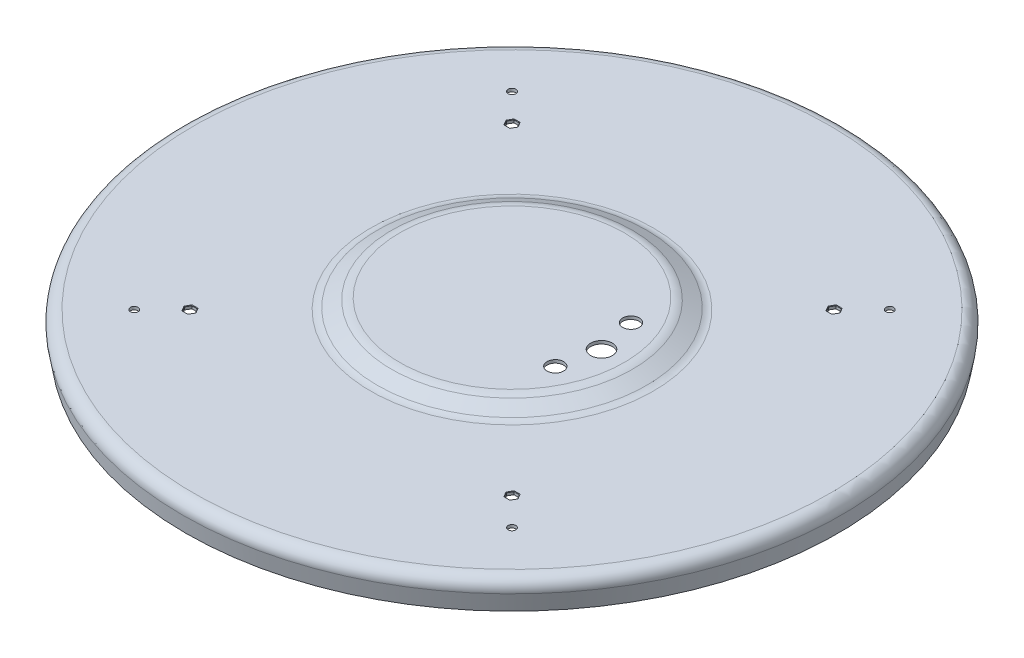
ISO-10303-21;
HEADER;
FILE_DESCRIPTION(('STEP AP214'),'2;1');
FILE_NAME('part.step','',(''),(''),'','','');
FILE_SCHEMA(('AUTOMOTIVE_DESIGN { 1 0 10303 214 1 1 1 1 }'));
ENDSEC;
DATA;
#1=APPLICATION_CONTEXT('core data for automotive mechanical design processes');
#2=APPLICATION_PROTOCOL_DEFINITION('international standard','automotive_design',2000,#1);
#3=PRODUCT_CONTEXT('',#1,'mechanical');
#4=PRODUCT('Part','Part','',(#3));
#5=PRODUCT_RELATED_PRODUCT_CATEGORY('part','',(#4));
#6=PRODUCT_DEFINITION_FORMATION('','',#4);
#7=PRODUCT_DEFINITION_CONTEXT('part definition',#1,'design');
#8=PRODUCT_DEFINITION('design','',#6,#7);
#9=PRODUCT_DEFINITION_SHAPE('','',#8);
#10=(LENGTH_UNIT() NAMED_UNIT(*) SI_UNIT(.MILLI.,.METRE.));
#11=(NAMED_UNIT(*) PLANE_ANGLE_UNIT() SI_UNIT($,.RADIAN.));
#12=(NAMED_UNIT(*) SI_UNIT($,.STERADIAN.) SOLID_ANGLE_UNIT());
#13=UNCERTAINTY_MEASURE_WITH_UNIT(LENGTH_MEASURE(1.E-05),#10,'distance_accuracy_value','');
#14=(GEOMETRIC_REPRESENTATION_CONTEXT(3) GLOBAL_UNCERTAINTY_ASSIGNED_CONTEXT((#13)) GLOBAL_UNIT_ASSIGNED_CONTEXT((#10,
#11,#12)) REPRESENTATION_CONTEXT('',''));
#15=CARTESIAN_POINT('',(0.,0.,0.));
#16=DIRECTION('',(0.,0.,1.));
#17=DIRECTION('',(1.,0.,0.));
#18=AXIS2_PLACEMENT_3D('',#15,#16,#17);
#19=CARTESIAN_POINT('',(-136.966061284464,29.5209426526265,0.));
#20=DIRECTION('',(0.,-1.,0.));
#21=DIRECTION('',(0.,0.,-1.));
#22=AXIS2_PLACEMENT_3D('',#19,#20,#21);
#23=PLANE('',#22);
#24=DIRECTION('',(0.499999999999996,0.,0.866025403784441));
#25=VECTOR('',#24,1.);
#26=CARTESIAN_POINT('',(-150.356401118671,29.5209426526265,-156.225000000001));
#27=LINE('',#26,#25);
#28=CARTESIAN_POINT('',(-153.113248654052,29.5209426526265,-161.000000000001));
#29=VERTEX_POINT('',#28);
#30=CARTESIAN_POINT('',(-150.226497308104,29.5209426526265,-156.000000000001));
#31=VERTEX_POINT('',#30);
#32=EDGE_CURVE('E593',#29,#31,#27,.T.);
#33=ORIENTED_EDGE('',*,*,#32,.T.);
#34=DIRECTION('',(-0.499999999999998,0.,0.86602540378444));
#35=VECTOR('',#34,1.);
#36=CARTESIAN_POINT('',(-152.983344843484,29.5209426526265,-151.225000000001));
#37=LINE('',#36,#35);
#38=CARTESIAN_POINT('',(-153.113248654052,29.5209426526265,-151.000000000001));
#39=VERTEX_POINT('',#38);
#40=EDGE_CURVE('E617',#31,#39,#37,.T.);
#41=ORIENTED_EDGE('',*,*,#40,.T.);
#42=DIRECTION('',(-1.,0.,0.));
#43=VECTOR('',#42,1.);
#44=CARTESIAN_POINT('',(-158.626943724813,29.5209426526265,-151.000000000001));
#45=LINE('',#44,#43);
#46=CARTESIAN_POINT('',(-158.886751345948,29.5209426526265,-151.000000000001));
#47=VERTEX_POINT('',#46);
#48=EDGE_CURVE('E615',#39,#47,#45,.T.);
#49=ORIENTED_EDGE('',*,*,#48,.T.);
#50=DIRECTION('',(-0.5,0.,-0.866025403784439));
#51=VECTOR('',#50,1.);
#52=CARTESIAN_POINT('',(-161.643598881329,29.5209426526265,-155.775000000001));
#53=LINE('',#52,#51);
#54=CARTESIAN_POINT('',(-161.773502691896,29.5209426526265,-156.000000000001));
#55=VERTEX_POINT('',#54);
#56=EDGE_CURVE('E613',#47,#55,#53,.T.);
#57=ORIENTED_EDGE('',*,*,#56,.T.);
#58=DIRECTION('',(0.500000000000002,0.,-0.866025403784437));
#59=VECTOR('',#58,1.);
#60=CARTESIAN_POINT('',(-159.016655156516,29.5209426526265,-160.775000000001));
#61=LINE('',#60,#59);
#62=CARTESIAN_POINT('',(-158.886751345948,29.5209426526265,-161.000000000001));
#63=VERTEX_POINT('',#62);
#64=EDGE_CURVE('E611',#55,#63,#61,.T.);
#65=ORIENTED_EDGE('',*,*,#64,.T.);
#66=DIRECTION('',(1.,0.,0.));
#67=VECTOR('',#66,1.);
#68=CARTESIAN_POINT('',(-153.373056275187,29.5209426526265,-161.000000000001));
#69=LINE('',#68,#67);
#70=EDGE_CURVE('E609',#63,#29,#69,.T.);
#71=ORIENTED_EDGE('',*,*,#70,.T.);
#72=EDGE_LOOP('',(#33,#41,#49,#57,#65,#71));
#73=FACE_BOUND('',#72,.T.);
#74=CARTESIAN_POINT('',(-182.999234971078,29.5209426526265,-182.999234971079));
#75=DIRECTION('',(0.,-1.,0.));
#76=DIRECTION('',(0.,0.,1.));
#77=AXIS2_PLACEMENT_3D('',#74,#75,#76);
#78=CIRCLE('',#77,3.75000000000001);
#79=CARTESIAN_POINT('',(-182.999234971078,29.5209426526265,-179.249234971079));
#80=VERTEX_POINT('',#79);
#81=EDGE_CURVE('E310',#80,#80,#78,.T.);
#82=ORIENTED_EDGE('',*,*,#81,.T.);
#83=EDGE_LOOP('',(#82));
#84=FACE_BOUND('',#83,.T.);
#85=DIRECTION('',(1.,0.,0.));
#86=VECTOR('',#85,1.);
#87=CARTESIAN_POINT('',(-136.966061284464,29.5209426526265,151.000000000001));
#88=LINE('',#87,#86);
#89=CARTESIAN_POINT('',(-158.886751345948,29.5209426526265,151.000000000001));
#90=VERTEX_POINT('',#89);
#91=CARTESIAN_POINT('',(-153.113248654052,29.5209426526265,151.000000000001));
#92=VERTEX_POINT('',#91);
#93=EDGE_CURVE('E578',#90,#92,#88,.T.);
#94=ORIENTED_EDGE('',*,*,#93,.T.);
#95=DIRECTION('',(0.499999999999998,0.,0.86602540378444));
#96=VECTOR('',#95,1.);
#97=CARTESIAN_POINT('',(-214.46136979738,29.5209426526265,44.7419372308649));
#98=LINE('',#97,#96);
#99=CARTESIAN_POINT('',(-150.226497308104,29.5209426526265,156.000000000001));
#100=VERTEX_POINT('',#99);
#101=EDGE_CURVE('E580',#92,#100,#98,.T.);
#102=ORIENTED_EDGE('',*,*,#101,.T.);
#103=DIRECTION('',(-0.499999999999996,0.,0.866025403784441));
#104=VECTOR('',#103,1.);
#105=CARTESIAN_POINT('',(-79.3614068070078,29.5209426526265,33.2580627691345));
#106=LINE('',#105,#104);
#107=CARTESIAN_POINT('',(-153.113248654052,29.5209426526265,161.000000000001));
#108=VERTEX_POINT('',#107);
#109=EDGE_CURVE('E570',#100,#108,#106,.T.);
#110=ORIENTED_EDGE('',*,*,#109,.T.);
#111=DIRECTION('',(-1.,0.,0.));
#112=VECTOR('',#111,1.);
#113=CARTESIAN_POINT('',(-136.966061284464,29.5209426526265,161.000000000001));
#114=LINE('',#113,#112);
#115=CARTESIAN_POINT('',(-158.886751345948,29.5209426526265,161.000000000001));
#116=VERTEX_POINT('',#115);
#117=EDGE_CURVE('E572',#108,#116,#114,.T.);
#118=ORIENTED_EDGE('',*,*,#117,.T.);
#119=DIRECTION('',(-0.500000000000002,0.,-0.866025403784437));
#120=VECTOR('',#119,1.);
#121=CARTESIAN_POINT('',(-223.121623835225,29.5209426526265,49.7419372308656));
#122=LINE('',#121,#120);
#123=CARTESIAN_POINT('',(-161.773502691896,29.5209426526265,156.000000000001));
#124=VERTEX_POINT('',#123);
#125=EDGE_CURVE('E574',#116,#124,#122,.T.);
#126=ORIENTED_EDGE('',*,*,#125,.T.);
#127=DIRECTION('',(0.5,0.,-0.866025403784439));
#128=VECTOR('',#127,1.);
#129=CARTESIAN_POINT('',(-88.0216608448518,29.5209426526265,28.2580627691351));
#130=LINE('',#129,#128);
#131=EDGE_CURVE('E576',#124,#90,#130,.T.);
#132=ORIENTED_EDGE('',*,*,#131,.T.);
#133=EDGE_LOOP('',(#94,#102,#110,#118,#126,#132));
#134=FACE_BOUND('',#133,.T.);
#135=CARTESIAN_POINT('',(-182.999234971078,29.5209426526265,182.999234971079));
#136=DIRECTION('',(0.,1.,0.));
#137=DIRECTION('',(0.,0.,-1.));
#138=AXIS2_PLACEMENT_3D('',#135,#136,#137);
#139=CIRCLE('',#138,3.75000000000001);
#140=CARTESIAN_POINT('',(-182.999234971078,29.5209426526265,179.249234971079));
#141=VERTEX_POINT('',#140);
#142=EDGE_CURVE('E352',#141,#141,#139,.T.);
#143=ORIENTED_EDGE('',*,*,#142,.F.);
#144=EDGE_LOOP('',(#143));
#145=FACE_BOUND('',#144,.T.);
#146=DIRECTION('',(-0.499999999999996,0.,-0.866025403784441));
#147=VECTOR('',#146,1.);
#148=CARTESIAN_POINT('',(150.356401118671,29.5209426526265,156.225000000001));
#149=LINE('',#148,#147);
#150=CARTESIAN_POINT('',(153.113248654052,29.5209426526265,161.000000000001));
#151=VERTEX_POINT('',#150);
#152=CARTESIAN_POINT('',(150.226497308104,29.5209426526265,156.000000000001));
#153=VERTEX_POINT('',#152);
#154=EDGE_CURVE('E513',#151,#153,#149,.T.);
#155=ORIENTED_EDGE('',*,*,#154,.T.);
#156=DIRECTION('',(0.499999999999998,0.,-0.86602540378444));
#157=VECTOR('',#156,1.);
#158=CARTESIAN_POINT('',(152.983344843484,29.5209426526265,151.225000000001));
#159=LINE('',#158,#157);
#160=CARTESIAN_POINT('',(153.113248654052,29.5209426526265,151.000000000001));
#161=VERTEX_POINT('',#160);
#162=EDGE_CURVE('E537',#153,#161,#159,.T.);
#163=ORIENTED_EDGE('',*,*,#162,.T.);
#164=DIRECTION('',(1.,0.,0.));
#165=VECTOR('',#164,1.);
#166=CARTESIAN_POINT('',(158.626943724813,29.5209426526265,151.000000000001));
#167=LINE('',#166,#165);
#168=CARTESIAN_POINT('',(158.886751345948,29.5209426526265,151.000000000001));
#169=VERTEX_POINT('',#168);
#170=EDGE_CURVE('E535',#161,#169,#167,.T.);
#171=ORIENTED_EDGE('',*,*,#170,.T.);
#172=DIRECTION('',(0.5,0.,0.866025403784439));
#173=VECTOR('',#172,1.);
#174=CARTESIAN_POINT('',(161.643598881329,29.5209426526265,155.775000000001));
#175=LINE('',#174,#173);
#176=CARTESIAN_POINT('',(161.773502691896,29.5209426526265,156.000000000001));
#177=VERTEX_POINT('',#176);
#178=EDGE_CURVE('E533',#169,#177,#175,.T.);
#179=ORIENTED_EDGE('',*,*,#178,.T.);
#180=DIRECTION('',(-0.500000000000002,0.,0.866025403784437));
#181=VECTOR('',#180,1.);
#182=CARTESIAN_POINT('',(159.016655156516,29.5209426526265,160.775000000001));
#183=LINE('',#182,#181);
#184=CARTESIAN_POINT('',(158.886751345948,29.5209426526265,161.000000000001));
#185=VERTEX_POINT('',#184);
#186=EDGE_CURVE('E531',#177,#185,#183,.T.);
#187=ORIENTED_EDGE('',*,*,#186,.T.);
#188=DIRECTION('',(-1.,0.,0.));
#189=VECTOR('',#188,1.);
#190=CARTESIAN_POINT('',(153.373056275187,29.5209426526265,161.000000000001));
#191=LINE('',#190,#189);
#192=EDGE_CURVE('E529',#185,#151,#191,.T.);
#193=ORIENTED_EDGE('',*,*,#192,.T.);
#194=EDGE_LOOP('',(#155,#163,#171,#179,#187,#193));
#195=FACE_BOUND('',#194,.T.);
#196=CARTESIAN_POINT('',(182.999234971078,29.5209426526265,182.999234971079));
#197=DIRECTION('',(0.,-1.,0.));
#198=DIRECTION('',(0.,0.,-1.));
#199=AXIS2_PLACEMENT_3D('',#196,#197,#198);
#200=CIRCLE('',#199,3.75000000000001);
#201=CARTESIAN_POINT('',(182.999234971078,29.5209426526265,179.249234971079));
#202=VERTEX_POINT('',#201);
#203=EDGE_CURVE('E397',#202,#202,#200,.T.);
#204=ORIENTED_EDGE('',*,*,#203,.T.);
#205=EDGE_LOOP('',(#204));
#206=FACE_BOUND('',#205,.T.);
#207=DIRECTION('',(-1.,0.,0.));
#208=VECTOR('',#207,1.);
#209=CARTESIAN_POINT('',(-136.966061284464,29.5209426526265,-151.000000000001));
#210=LINE('',#209,#208);
#211=CARTESIAN_POINT('',(158.886751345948,29.5209426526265,-151.000000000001));
#212=VERTEX_POINT('',#211);
#213=CARTESIAN_POINT('',(153.113248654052,29.5209426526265,-151.000000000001));
#214=VERTEX_POINT('',#213);
#215=EDGE_CURVE('E498',#212,#214,#210,.T.);
#216=ORIENTED_EDGE('',*,*,#215,.T.);
#217=DIRECTION('',(-0.499999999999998,0.,-0.86602540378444));
#218=VECTOR('',#217,1.);
#219=CARTESIAN_POINT('',(145.978339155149,29.5209426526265,-163.358025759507));
#220=LINE('',#219,#218);
#221=CARTESIAN_POINT('',(150.226497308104,29.5209426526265,-156.000000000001));
#222=VERTEX_POINT('',#221);
#223=EDGE_CURVE('E500',#214,#222,#220,.T.);
#224=ORIENTED_EDGE('',*,*,#223,.T.);
#225=DIRECTION('',(0.499999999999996,0.,-0.866025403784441));
#226=VECTOR('',#225,1.);
#227=CARTESIAN_POINT('',(10.8783761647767,29.5209426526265,85.3580257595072));
#228=LINE('',#227,#226);
#229=CARTESIAN_POINT('',(153.113248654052,29.5209426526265,-161.000000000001));
#230=VERTEX_POINT('',#229);
#231=EDGE_CURVE('E490',#222,#230,#228,.T.);
#232=ORIENTED_EDGE('',*,*,#231,.T.);
#233=DIRECTION('',(1.,0.,0.));
#234=VECTOR('',#233,1.);
#235=CARTESIAN_POINT('',(-136.966061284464,29.5209426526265,-161.000000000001));
#236=LINE('',#235,#234);
#237=CARTESIAN_POINT('',(158.886751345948,29.5209426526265,-161.000000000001));
#238=VERTEX_POINT('',#237);
#239=EDGE_CURVE('E492',#230,#238,#236,.T.);
#240=ORIENTED_EDGE('',*,*,#239,.T.);
#241=DIRECTION('',(0.500000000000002,0.,0.866025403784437));
#242=VECTOR('',#241,1.);
#243=CARTESIAN_POINT('',(154.638593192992,29.5209426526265,-168.358025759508));
#244=LINE('',#243,#242);
#245=CARTESIAN_POINT('',(161.773502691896,29.5209426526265,-156.000000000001));
#246=VERTEX_POINT('',#245);
#247=EDGE_CURVE('E494',#238,#246,#244,.T.);
#248=ORIENTED_EDGE('',*,*,#247,.T.);
#249=DIRECTION('',(-0.5,0.,0.866025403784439));
#250=VECTOR('',#249,1.);
#251=CARTESIAN_POINT('',(19.5386302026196,29.5209426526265,90.3580257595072));
#252=LINE('',#251,#250);
#253=EDGE_CURVE('E496',#246,#212,#252,.T.);
#254=ORIENTED_EDGE('',*,*,#253,.T.);
#255=EDGE_LOOP('',(#216,#224,#232,#240,#248,#254));
#256=FACE_BOUND('',#255,.T.);
#257=CARTESIAN_POINT('',(182.999234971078,29.5209426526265,-182.999234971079));
#258=DIRECTION('',(0.,1.,0.));
#259=DIRECTION('',(0.,0.,1.));
#260=AXIS2_PLACEMENT_3D('',#257,#258,#259);
#261=CIRCLE('',#260,3.75000000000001);
#262=CARTESIAN_POINT('',(182.999234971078,29.5209426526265,-179.249234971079));
#263=VERTEX_POINT('',#262);
#264=EDGE_CURVE('E439',#263,#263,#261,.T.);
#265=ORIENTED_EDGE('',*,*,#264,.F.);
#266=EDGE_LOOP('',(#265));
#267=FACE_BOUND('',#266,.T.);
#268=CARTESIAN_POINT('',(0.,29.5209426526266,0.));
#269=DIRECTION('',(0.,-1.,0.));
#270=DIRECTION('',(0.,0.,-1.));
#271=AXIS2_PLACEMENT_3D('',#268,#269,#270);
#272=CIRCLE('',#271,308.321);
#273=CARTESIAN_POINT('',(0.,29.5209426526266,-308.321));
#274=VERTEX_POINT('',#273);
#275=EDGE_CURVE('E472',#274,#274,#272,.T.);
#276=ORIENTED_EDGE('',*,*,#275,.F.);
#277=EDGE_LOOP('',(#276));
#278=FACE_BOUND('',#277,.T.);
#279=CARTESIAN_POINT('',(0.,29.5209426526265,0.));
#280=DIRECTION('',(0.,-1.,0.));
#281=DIRECTION('',(0.,0.,-1.));
#282=AXIS2_PLACEMENT_3D('',#279,#280,#281);
#283=CIRCLE('',#282,136.966061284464);
#284=CARTESIAN_POINT('',(0.,29.5209426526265,-136.966061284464));
#285=VERTEX_POINT('',#284);
#286=EDGE_CURVE('E475',#285,#285,#283,.T.);
#287=ORIENTED_EDGE('',*,*,#286,.T.);
#288=EDGE_LOOP('',(#287));
#289=FACE_BOUND('',#288,.T.);
#290=ADVANCED_FACE('F38',(#73,#84,#134,#145,#195,#206,#256,#267,#278,#289),#23,.F.);
#291=CARTESIAN_POINT('',(-136.966061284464,26.5209426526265,0.));
#292=DIRECTION('',(0.,1.,0.));
#293=DIRECTION('',(0.,0.,1.));
#294=AXIS2_PLACEMENT_3D('',#291,#292,#293);
#295=PLANE('',#294);
#296=CARTESIAN_POINT('',(-182.999234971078,26.5209426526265,-182.999234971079));
#297=DIRECTION('',(0.,1.,0.));
#298=DIRECTION('',(0.,0.,1.));
#299=AXIS2_PLACEMENT_3D('',#296,#297,#298);
#300=CIRCLE('',#299,3.75000000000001);
#301=CARTESIAN_POINT('',(-182.999234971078,26.5209426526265,-179.249234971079));
#302=VERTEX_POINT('',#301);
#303=EDGE_CURVE('E279',#302,#302,#300,.T.);
#304=ORIENTED_EDGE('',*,*,#303,.T.);
#305=EDGE_LOOP('',(#304));
#306=FACE_BOUND('',#305,.T.);
#307=DIRECTION('',(-0.499999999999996,0.,0.866025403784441));
#308=VECTOR('',#307,1.);
#309=CARTESIAN_POINT('',(-153.373056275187,26.5209426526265,160.550000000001));
#310=LINE('',#309,#308);
#311=CARTESIAN_POINT('',(-150.746112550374,26.5209426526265,156.000000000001));
#312=VERTEX_POINT('',#311);
#313=CARTESIAN_POINT('',(-153.373056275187,26.5209426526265,160.550000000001));
#314=VERTEX_POINT('',#313);
#315=EDGE_CURVE('E325',#312,#314,#310,.T.);
#316=ORIENTED_EDGE('',*,*,#315,.F.);
#317=DIRECTION('',(0.499999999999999,0.,0.86602540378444));
#318=VECTOR('',#317,1.);
#319=CARTESIAN_POINT('',(-150.746112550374,26.5209426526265,156.000000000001));
#320=LINE('',#319,#318);
#321=CARTESIAN_POINT('',(-153.373056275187,26.5209426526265,151.450000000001));
#322=VERTEX_POINT('',#321);
#323=EDGE_CURVE('E328',#322,#312,#320,.T.);
#324=ORIENTED_EDGE('',*,*,#323,.F.);
#325=DIRECTION('',(1.,0.,0.));
#326=VECTOR('',#325,1.);
#327=CARTESIAN_POINT('',(-153.373056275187,26.5209426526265,151.450000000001));
#328=LINE('',#327,#326);
#329=CARTESIAN_POINT('',(-158.626943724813,26.5209426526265,151.450000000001));
#330=VERTEX_POINT('',#329);
#331=EDGE_CURVE('E335',#330,#322,#328,.T.);
#332=ORIENTED_EDGE('',*,*,#331,.F.);
#333=DIRECTION('',(0.5,0.,-0.866025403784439));
#334=VECTOR('',#333,1.);
#335=CARTESIAN_POINT('',(-158.626943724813,26.5209426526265,151.450000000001));
#336=LINE('',#335,#334);
#337=CARTESIAN_POINT('',(-161.253887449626,26.5209426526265,156.000000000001));
#338=VERTEX_POINT('',#337);
#339=EDGE_CURVE('E316',#338,#330,#336,.T.);
#340=ORIENTED_EDGE('',*,*,#339,.F.);
#341=DIRECTION('',(-0.500000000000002,0.,-0.866025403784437));
#342=VECTOR('',#341,1.);
#343=CARTESIAN_POINT('',(-161.253887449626,26.5209426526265,156.000000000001));
#344=LINE('',#343,#342);
#345=CARTESIAN_POINT('',(-158.626943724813,26.5209426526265,160.550000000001));
#346=VERTEX_POINT('',#345);
#347=EDGE_CURVE('E318',#346,#338,#344,.T.);
#348=ORIENTED_EDGE('',*,*,#347,.F.);
#349=DIRECTION('',(-1.,0.,0.));
#350=VECTOR('',#349,1.);
#351=CARTESIAN_POINT('',(-158.626943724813,26.5209426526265,160.550000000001));
#352=LINE('',#351,#350);
#353=EDGE_CURVE('E322',#314,#346,#352,.T.);
#354=ORIENTED_EDGE('',*,*,#353,.F.);
#355=EDGE_LOOP('',(#316,#324,#332,#340,#348,#354));
#356=FACE_BOUND('',#355,.T.);
#357=CARTESIAN_POINT('',(-182.999234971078,26.5209426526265,182.999234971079));
#358=DIRECTION('',(0.,1.,0.));
#359=DIRECTION('',(0.,0.,1.));
#360=AXIS2_PLACEMENT_3D('',#357,#358,#359);
#361=CIRCLE('',#360,3.75000000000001);
#362=CARTESIAN_POINT('',(-182.999234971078,26.5209426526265,186.749234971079));
#363=VERTEX_POINT('',#362);
#364=EDGE_CURVE('E355',#363,#363,#361,.F.);
#365=ORIENTED_EDGE('',*,*,#364,.F.);
#366=EDGE_LOOP('',(#365));
#367=FACE_BOUND('',#366,.T.);
#368=CARTESIAN_POINT('',(182.999234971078,26.5209426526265,182.999234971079));
#369=DIRECTION('',(0.,1.,0.));
#370=DIRECTION('',(0.,0.,1.));
#371=AXIS2_PLACEMENT_3D('',#368,#369,#370);
#372=CIRCLE('',#371,3.75000000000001);
#373=CARTESIAN_POINT('',(182.999234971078,26.5209426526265,186.749234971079));
#374=VERTEX_POINT('',#373);
#375=EDGE_CURVE('E396',#374,#374,#372,.T.);
#376=ORIENTED_EDGE('',*,*,#375,.T.);
#377=EDGE_LOOP('',(#376));
#378=FACE_BOUND('',#377,.T.);
#379=DIRECTION('',(0.499999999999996,0.,-0.866025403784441));
#380=VECTOR('',#379,1.);
#381=CARTESIAN_POINT('',(153.373056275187,26.5209426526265,-160.550000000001));
#382=LINE('',#381,#380);
#383=CARTESIAN_POINT('',(150.746112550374,26.5209426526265,-156.000000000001));
#384=VERTEX_POINT('',#383);
#385=CARTESIAN_POINT('',(153.373056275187,26.5209426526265,-160.550000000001));
#386=VERTEX_POINT('',#385);
#387=EDGE_CURVE('E412',#384,#386,#382,.T.);
#388=ORIENTED_EDGE('',*,*,#387,.F.);
#389=DIRECTION('',(-0.499999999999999,0.,-0.86602540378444));
#390=VECTOR('',#389,1.);
#391=CARTESIAN_POINT('',(150.746112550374,26.5209426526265,-156.000000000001));
#392=LINE('',#391,#390);
#393=CARTESIAN_POINT('',(153.373056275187,26.5209426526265,-151.450000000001));
#394=VERTEX_POINT('',#393);
#395=EDGE_CURVE('E415',#394,#384,#392,.T.);
#396=ORIENTED_EDGE('',*,*,#395,.F.);
#397=DIRECTION('',(-1.,0.,0.));
#398=VECTOR('',#397,1.);
#399=CARTESIAN_POINT('',(153.373056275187,26.5209426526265,-151.450000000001));
#400=LINE('',#399,#398);
#401=CARTESIAN_POINT('',(158.626943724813,26.5209426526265,-151.450000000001));
#402=VERTEX_POINT('',#401);
#403=EDGE_CURVE('E422',#402,#394,#400,.T.);
#404=ORIENTED_EDGE('',*,*,#403,.F.);
#405=DIRECTION('',(-0.5,0.,0.866025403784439));
#406=VECTOR('',#405,1.);
#407=CARTESIAN_POINT('',(158.626943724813,26.5209426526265,-151.450000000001));
#408=LINE('',#407,#406);
#409=CARTESIAN_POINT('',(161.253887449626,26.5209426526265,-156.000000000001));
#410=VERTEX_POINT('',#409);
#411=EDGE_CURVE('E403',#410,#402,#408,.T.);
#412=ORIENTED_EDGE('',*,*,#411,.F.);
#413=DIRECTION('',(0.500000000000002,0.,0.866025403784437));
#414=VECTOR('',#413,1.);
#415=CARTESIAN_POINT('',(161.253887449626,26.5209426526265,-156.000000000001));
#416=LINE('',#415,#414);
#417=CARTESIAN_POINT('',(158.626943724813,26.5209426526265,-160.550000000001));
#418=VERTEX_POINT('',#417);
#419=EDGE_CURVE('E405',#418,#410,#416,.T.);
#420=ORIENTED_EDGE('',*,*,#419,.F.);
#421=DIRECTION('',(1.,0.,0.));
#422=VECTOR('',#421,1.);
#423=CARTESIAN_POINT('',(158.626943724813,26.5209426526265,-160.550000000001));
#424=LINE('',#423,#422);
#425=EDGE_CURVE('E409',#386,#418,#424,.T.);
#426=ORIENTED_EDGE('',*,*,#425,.F.);
#427=EDGE_LOOP('',(#388,#396,#404,#412,#420,#426));
#428=FACE_BOUND('',#427,.T.);
#429=CARTESIAN_POINT('',(182.999234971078,26.5209426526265,-182.999234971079));
#430=DIRECTION('',(0.,1.,0.));
#431=DIRECTION('',(0.,0.,1.));
#432=AXIS2_PLACEMENT_3D('',#429,#430,#431);
#433=CIRCLE('',#432,3.75000000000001);
#434=CARTESIAN_POINT('',(182.999234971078,26.5209426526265,-179.249234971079));
#435=VERTEX_POINT('',#434);
#436=EDGE_CURVE('E442',#435,#435,#433,.F.);
#437=ORIENTED_EDGE('',*,*,#436,.F.);
#438=EDGE_LOOP('',(#437));
#439=FACE_BOUND('',#438,.T.);
#440=CARTESIAN_POINT('',(0.,26.5209426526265,0.));
#441=DIRECTION('',(0.,-1.,0.));
#442=DIRECTION('',(0.,0.,-1.));
#443=AXIS2_PLACEMENT_3D('',#440,#441,#442);
#444=CIRCLE('',#443,136.966061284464);
#445=CARTESIAN_POINT('',(0.,26.5209426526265,-136.966061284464));
#446=VERTEX_POINT('',#445);
#447=EDGE_CURVE('E454',#446,#446,#444,.T.);
#448=ORIENTED_EDGE('',*,*,#447,.F.);
#449=EDGE_LOOP('',(#448));
#450=FACE_BOUND('',#449,.T.);
#451=CARTESIAN_POINT('',(0.,26.5209426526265,0.));
#452=DIRECTION('',(0.,-1.,0.));
#453=DIRECTION('',(0.,0.,-1.));
#454=AXIS2_PLACEMENT_3D('',#451,#452,#453);
#455=CIRCLE('',#454,308.321);
#456=CARTESIAN_POINT('',(0.,26.5209426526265,-308.321));
#457=VERTEX_POINT('',#456);
#458=EDGE_CURVE('E457',#457,#457,#455,.T.);
#459=ORIENTED_EDGE('',*,*,#458,.T.);
#460=EDGE_LOOP('',(#459));
#461=FACE_BOUND('',#460,.T.);
#462=DIRECTION('',(-0.499999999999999,0.,0.86602540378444));
#463=VECTOR('',#462,1.);
#464=CARTESIAN_POINT('',(150.746112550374,26.5209426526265,156.000000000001));
#465=LINE('',#464,#463);
#466=CARTESIAN_POINT('',(153.373056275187,26.5209426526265,151.450000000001));
#467=VERTEX_POINT('',#466);
#468=CARTESIAN_POINT('',(150.746112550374,26.5209426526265,156.000000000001));
#469=VERTEX_POINT('',#468);
#470=EDGE_CURVE('E372',#467,#469,#465,.T.);
#471=ORIENTED_EDGE('',*,*,#470,.T.);
#472=DIRECTION('',(0.499999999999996,0.,0.866025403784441));
#473=VECTOR('',#472,1.);
#474=CARTESIAN_POINT('',(153.373056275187,26.5209426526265,160.550000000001));
#475=LINE('',#474,#473);
#476=CARTESIAN_POINT('',(153.373056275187,26.5209426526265,160.550000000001));
#477=VERTEX_POINT('',#476);
#478=EDGE_CURVE('E379',#469,#477,#475,.T.);
#479=ORIENTED_EDGE('',*,*,#478,.T.);
#480=DIRECTION('',(1.,0.,0.));
#481=VECTOR('',#480,1.);
#482=CARTESIAN_POINT('',(158.626943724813,26.5209426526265,160.550000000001));
#483=LINE('',#482,#481);
#484=CARTESIAN_POINT('',(158.626943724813,26.5209426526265,160.550000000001));
#485=VERTEX_POINT('',#484);
#486=EDGE_CURVE('E359',#477,#485,#483,.T.);
#487=ORIENTED_EDGE('',*,*,#486,.T.);
#488=DIRECTION('',(0.500000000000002,0.,-0.866025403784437));
#489=VECTOR('',#488,1.);
#490=CARTESIAN_POINT('',(161.253887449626,26.5209426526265,156.000000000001));
#491=LINE('',#490,#489);
#492=CARTESIAN_POINT('',(161.253887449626,26.5209426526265,156.000000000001));
#493=VERTEX_POINT('',#492);
#494=EDGE_CURVE('E362',#485,#493,#491,.T.);
#495=ORIENTED_EDGE('',*,*,#494,.T.);
#496=DIRECTION('',(-0.5,0.,-0.866025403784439));
#497=VECTOR('',#496,1.);
#498=CARTESIAN_POINT('',(158.626943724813,26.5209426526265,151.450000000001));
#499=LINE('',#498,#497);
#500=CARTESIAN_POINT('',(158.626943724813,26.5209426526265,151.450000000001));
#501=VERTEX_POINT('',#500);
#502=EDGE_CURVE('E366',#493,#501,#499,.T.);
#503=ORIENTED_EDGE('',*,*,#502,.T.);
#504=DIRECTION('',(-1.,0.,0.));
#505=VECTOR('',#504,1.);
#506=CARTESIAN_POINT('',(153.373056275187,26.5209426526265,151.450000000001));
#507=LINE('',#506,#505);
#508=EDGE_CURVE('E369',#501,#467,#507,.T.);
#509=ORIENTED_EDGE('',*,*,#508,.T.);
#510=EDGE_LOOP('',(#471,#479,#487,#495,#503,#509));
#511=FACE_BOUND('',#510,.T.);
#512=DIRECTION('',(0.499999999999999,0.,-0.86602540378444));
#513=VECTOR('',#512,1.);
#514=CARTESIAN_POINT('',(-150.746112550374,26.5209426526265,-156.000000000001));
#515=LINE('',#514,#513);
#516=CARTESIAN_POINT('',(-153.373056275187,26.5209426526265,-151.450000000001));
#517=VERTEX_POINT('',#516);
#518=CARTESIAN_POINT('',(-150.746112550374,26.5209426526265,-156.000000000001));
#519=VERTEX_POINT('',#518);
#520=EDGE_CURVE('E286',#517,#519,#515,.T.);
#521=ORIENTED_EDGE('',*,*,#520,.T.);
#522=DIRECTION('',(-0.499999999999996,0.,-0.866025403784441));
#523=VECTOR('',#522,1.);
#524=CARTESIAN_POINT('',(-153.373056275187,26.5209426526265,-160.550000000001));
#525=LINE('',#524,#523);
#526=CARTESIAN_POINT('',(-153.373056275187,26.5209426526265,-160.550000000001));
#527=VERTEX_POINT('',#526);
#528=EDGE_CURVE('E270',#519,#527,#525,.T.);
#529=ORIENTED_EDGE('',*,*,#528,.T.);
#530=DIRECTION('',(-1.,0.,0.));
#531=VECTOR('',#530,1.);
#532=CARTESIAN_POINT('',(-158.626943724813,26.5209426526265,-160.550000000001));
#533=LINE('',#532,#531);
#534=CARTESIAN_POINT('',(-158.626943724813,26.5209426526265,-160.550000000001));
#535=VERTEX_POINT('',#534);
#536=EDGE_CURVE('E645',#527,#535,#533,.T.);
#537=ORIENTED_EDGE('',*,*,#536,.T.);
#538=DIRECTION('',(-0.500000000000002,0.,0.866025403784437));
#539=VECTOR('',#538,1.);
#540=CARTESIAN_POINT('',(-161.253887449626,26.5209426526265,-156.000000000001));
#541=LINE('',#540,#539);
#542=CARTESIAN_POINT('',(-161.253887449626,26.5209426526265,-156.000000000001));
#543=VERTEX_POINT('',#542);
#544=EDGE_CURVE('E664',#535,#543,#541,.T.);
#545=ORIENTED_EDGE('',*,*,#544,.T.);
#546=DIRECTION('',(0.5,0.,0.866025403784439));
#547=VECTOR('',#546,1.);
#548=CARTESIAN_POINT('',(-158.626943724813,26.5209426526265,-151.450000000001));
#549=LINE('',#548,#547);
#550=CARTESIAN_POINT('',(-158.626943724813,26.5209426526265,-151.450000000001));
#551=VERTEX_POINT('',#550);
#552=EDGE_CURVE('E296',#543,#551,#549,.T.);
#553=ORIENTED_EDGE('',*,*,#552,.T.);
#554=DIRECTION('',(1.,0.,0.));
#555=VECTOR('',#554,1.);
#556=CARTESIAN_POINT('',(-153.373056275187,26.5209426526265,-151.450000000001));
#557=LINE('',#556,#555);
#558=EDGE_CURVE('E294',#551,#517,#557,.T.);
#559=ORIENTED_EDGE('',*,*,#558,.T.);
#560=EDGE_LOOP('',(#521,#529,#537,#545,#553,#559));
#561=FACE_BOUND('',#560,.T.);
#562=ADVANCED_FACE('F292',(#306,#356,#367,#378,#428,#439,#450,#461,#511,#561),#295,.F.);
#563=CARTESIAN_POINT('',(0.,39.5209426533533,0.));
#564=DIRECTION('',(0.,-1.,0.));
#565=DIRECTION('',(0.,0.,-1.));
#566=AXIS2_PLACEMENT_3D('',#563,#564,#565);
#567=PLANE('',#566);
#568=CARTESIAN_POINT('',(78.613137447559,39.5209426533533,36.6579080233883));
#569=DIRECTION('',(0.,1.,0.));
#570=DIRECTION('',(0.,0.,1.));
#571=AXIS2_PLACEMENT_3D('',#568,#569,#570);
#572=CIRCLE('',#571,8.00000000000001);
#573=CARTESIAN_POINT('',(78.613137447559,39.5209426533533,44.6579080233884));
#574=VERTEX_POINT('',#573);
#575=EDGE_CURVE('E660',#574,#574,#572,.T.);
#576=ORIENTED_EDGE('',*,*,#575,.F.);
#577=EDGE_LOOP('',(#576));
#578=FACE_BOUND('',#577,.T.);
#579=CARTESIAN_POINT('',(86.74,39.5209426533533,0.));
#580=DIRECTION('',(0.,1.,0.));
#581=DIRECTION('',(0.,0.,1.));
#582=AXIS2_PLACEMENT_3D('',#579,#580,#581);
#583=CIRCLE('',#582,10.5);
#584=CARTESIAN_POINT('',(86.74,39.5209426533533,10.5));
#585=VERTEX_POINT('',#584);
#586=EDGE_CURVE('E650',#585,#585,#583,.T.);
#587=ORIENTED_EDGE('',*,*,#586,.F.);
#588=EDGE_LOOP('',(#587));
#589=FACE_BOUND('',#588,.T.);
#590=CARTESIAN_POINT('',(78.6131374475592,39.5209426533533,-36.6579080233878));
#591=DIRECTION('',(0.,1.,0.));
#592=DIRECTION('',(0.,0.,1.));
#593=AXIS2_PLACEMENT_3D('',#590,#591,#592);
#594=CIRCLE('',#593,8.00000000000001);
#595=CARTESIAN_POINT('',(78.6131374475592,39.5209426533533,-28.6579080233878));
#596=VERTEX_POINT('',#595);
#597=EDGE_CURVE('E647',#596,#596,#594,.T.);
#598=ORIENTED_EDGE('',*,*,#597,.F.);
#599=EDGE_LOOP('',(#598));
#600=FACE_BOUND('',#599,.T.);
#601=CARTESIAN_POINT('',(0.,39.5209426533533,0.));
#602=DIRECTION('',(0.,-1.,0.));
#603=DIRECTION('',(0.,0.,-1.));
#604=AXIS2_PLACEMENT_3D('',#601,#602,#603);
#605=CIRCLE('',#604,108.844372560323);
#606=CARTESIAN_POINT('',(0.,39.5209426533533,-108.844372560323));
#607=VERTEX_POINT('',#606);
#608=EDGE_CURVE('E484',#607,#607,#605,.T.);
#609=ORIENTED_EDGE('',*,*,#608,.F.);
#610=EDGE_LOOP('',(#609));
#611=FACE_BOUND('',#610,.T.);
#612=ADVANCED_FACE('F716',(#578,#589,#600,#611),#567,.F.);
#613=CARTESIAN_POINT('',(0.,21.5209426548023,0.));
#614=DIRECTION('',(0.,-1.,0.));
#615=DIRECTION('',(0.,0.,-1.));
#616=AXIS2_PLACEMENT_3D('',#613,#614,#615);
#617=TOROIDAL_SURFACE('',#616,108.844372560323,17.999999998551);
#618=CARTESIAN_POINT('',(0.,37.6992354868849,0.));
#619=DIRECTION('',(0.,-1.,0.));
#620=DIRECTION('',(0.,0.,-1.));
#621=AXIS2_PLACEMENT_3D('',#618,#619,#620);
#622=CIRCLE('',#621,116.735053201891);
#623=CARTESIAN_POINT('',(0.,37.6992354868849,-116.735053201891));
#624=VERTEX_POINT('',#623);
#625=EDGE_CURVE('E481',#624,#624,#622,.T.);
#626=ORIENTED_EDGE('',*,*,#625,.F.);
#627=EDGE_LOOP('',(#626));
#628=FACE_BOUND('',#627,.T.);
#629=ORIENTED_EDGE('',*,*,#608,.T.);
#630=EDGE_LOOP('',(#629));
#631=FACE_BOUND('',#630,.T.);
#632=ADVANCED_FACE('F730',(#628,#631),#617,.T.);
#633=CARTESIAN_POINT('',(0.,37.6992354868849,0.));
#634=DIRECTION('',(0.,-1.,0.));
#635=DIRECTION('',(0.,0.,-1.));
#636=AXIS2_PLACEMENT_3D('',#633,#634,#635);
#637=CONICAL_SURFACE('',#636,116.735053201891,1.11701072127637);
#638=CARTESIAN_POINT('',(0.,31.0390319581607,0.));
#639=DIRECTION('',(0.,-1.,0.));
#640=DIRECTION('',(0.,0.,-1.));
#641=AXIS2_PLACEMENT_3D('',#638,#639,#640);
#642=CIRCLE('',#641,130.390494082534);
#643=CARTESIAN_POINT('',(0.,31.0390319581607,-130.390494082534));
#644=VERTEX_POINT('',#643);
#645=EDGE_CURVE('E478',#644,#644,#642,.T.);
#646=ORIENTED_EDGE('',*,*,#645,.F.);
#647=EDGE_LOOP('',(#646));
#648=FACE_BOUND('',#647,.T.);
#649=ORIENTED_EDGE('',*,*,#625,.T.);
#650=EDGE_LOOP('',(#649));
#651=FACE_BOUND('',#650,.T.);
#652=ADVANCED_FACE('F726',(#648,#651),#637,.T.);
#653=CARTESIAN_POINT('',(0.,44.5209426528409,0.));
#654=DIRECTION('',(0.,-1.,0.));
#655=DIRECTION('',(0.,0.,-1.));
#656=AXIS2_PLACEMENT_3D('',#653,#654,#655);
#657=TOROIDAL_SURFACE('',#656,136.966061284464,15.0000000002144);
#658=ORIENTED_EDGE('',*,*,#286,.F.);
#659=EDGE_LOOP('',(#658));
#660=FACE_BOUND('',#659,.T.);
#661=ORIENTED_EDGE('',*,*,#645,.T.);
#662=EDGE_LOOP('',(#661));
#663=FACE_BOUND('',#662,.T.);
#664=ADVANCED_FACE('F723',(#660,#663),#657,.F.);
#665=CARTESIAN_POINT('',(0.,18.5167644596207,0.));
#666=DIRECTION('',(0.,-1.,0.));
#667=DIRECTION('',(0.,0.,-1.));
#668=AXIS2_PLACEMENT_3D('',#665,#666,#667);
#669=TOROIDAL_SURFACE('',#668,308.321,11.0041781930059);
#670=CARTESIAN_POINT('',(0.,16.605908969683,0.));
#671=DIRECTION('',(0.,-1.,0.));
#672=DIRECTION('',(0.,0.,-1.));
#673=AXIS2_PLACEMENT_3D('',#670,#671,#672);
#674=CIRCLE('',#673,319.158);
#675=CARTESIAN_POINT('',(0.,16.605908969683,-319.158));
#676=VERTEX_POINT('',#675);
#677=EDGE_CURVE('E469',#676,#676,#674,.T.);
#678=ORIENTED_EDGE('',*,*,#677,.F.);
#679=EDGE_LOOP('',(#678));
#680=FACE_BOUND('',#679,.T.);
#681=ORIENTED_EDGE('',*,*,#275,.T.);
#682=EDGE_LOOP('',(#681));
#683=FACE_BOUND('',#682,.T.);
#684=ADVANCED_FACE('F721',(#680,#683),#669,.T.);
#685=CARTESIAN_POINT('',(0.,16.605908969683,0.));
#686=DIRECTION('',(0.,1.,0.));
#687=DIRECTION('',(0.,0.,1.));
#688=AXIS2_PLACEMENT_3D('',#685,#686,#687);
#689=CONICAL_SURFACE('',#688,319.158,0.174532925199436);
#690=CARTESIAN_POINT('',(0.,0.,0.));
#691=DIRECTION('',(0.,-1.,0.));
#692=DIRECTION('',(0.,0.,-1.));
#693=AXIS2_PLACEMENT_3D('',#690,#691,#692);
#694=CIRCLE('',#693,316.229930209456);
#695=CARTESIAN_POINT('',(0.,0.,-316.229930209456));
#696=VERTEX_POINT('',#695);
#697=EDGE_CURVE('E466',#696,#696,#694,.T.);
#698=ORIENTED_EDGE('',*,*,#697,.F.);
#699=EDGE_LOOP('',(#698));
#700=FACE_BOUND('',#699,.T.);
#701=ORIENTED_EDGE('',*,*,#677,.T.);
#702=EDGE_LOOP('',(#701));
#703=FACE_BOUND('',#702,.T.);
#704=ADVANCED_FACE('F951',(#700,#703),#689,.T.);
#705=CARTESIAN_POINT('',(0.,0.,0.));
#706=DIRECTION('',(0.,-1.,0.));
#707=DIRECTION('',(0.,0.,-1.));
#708=AXIS2_PLACEMENT_3D('',#705,#706,#707);
#709=CONICAL_SURFACE('',#708,316.229930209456,1.39626340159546);
#710=CARTESIAN_POINT('',(0.,0.520944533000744,0.));
#711=DIRECTION('',(0.,-1.,0.));
#712=DIRECTION('',(0.,0.,-1.));
#713=AXIS2_PLACEMENT_3D('',#710,#711,#712);
#714=CIRCLE('',#713,313.27550695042);
#715=CARTESIAN_POINT('',(0.,0.520944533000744,-313.27550695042));
#716=VERTEX_POINT('',#715);
#717=EDGE_CURVE('E463',#716,#716,#714,.T.);
#718=ORIENTED_EDGE('',*,*,#717,.F.);
#719=EDGE_LOOP('',(#718));
#720=FACE_BOUND('',#719,.T.);
#721=ORIENTED_EDGE('',*,*,#697,.T.);
#722=EDGE_LOOP('',(#721));
#723=FACE_BOUND('',#722,.T.);
#724=ADVANCED_FACE('F948',(#720,#723),#709,.F.);
#725=CARTESIAN_POINT('',(0.,0.520944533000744,0.));
#726=DIRECTION('',(0.,1.,0.));
#727=DIRECTION('',(0.,0.,1.));
#728=AXIS2_PLACEMENT_3D('',#725,#726,#727);
#729=CONICAL_SURFACE('',#728,313.27550695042,0.174532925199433);
#730=CARTESIAN_POINT('',(0.,17.1268535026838,0.));
#731=DIRECTION('',(0.,-1.,0.));
#732=DIRECTION('',(0.,0.,-1.));
#733=AXIS2_PLACEMENT_3D('',#730,#731,#732);
#734=CIRCLE('',#733,316.203576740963);
#735=CARTESIAN_POINT('',(0.,17.1268535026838,-316.203576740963));
#736=VERTEX_POINT('',#735);
#737=EDGE_CURVE('E460',#736,#736,#734,.T.);
#738=ORIENTED_EDGE('',*,*,#737,.F.);
#739=EDGE_LOOP('',(#738));
#740=FACE_BOUND('',#739,.T.);
#741=ORIENTED_EDGE('',*,*,#717,.T.);
#742=EDGE_LOOP('',(#741));
#743=FACE_BOUND('',#742,.T.);
#744=ADVANCED_FACE('F944',(#740,#743),#729,.F.);
#745=CARTESIAN_POINT('',(0.,18.5167644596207,0.));
#746=DIRECTION('',(0.,-1.,0.));
#747=DIRECTION('',(0.,0.,-1.));
#748=AXIS2_PLACEMENT_3D('',#745,#746,#747);
#749=TOROIDAL_SURFACE('',#748,308.321,8.00417819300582);
#750=ORIENTED_EDGE('',*,*,#458,.F.);
#751=EDGE_LOOP('',(#750));
#752=FACE_BOUND('',#751,.T.);
#753=ORIENTED_EDGE('',*,*,#737,.T.);
#754=EDGE_LOOP('',(#753));
#755=FACE_BOUND('',#754,.T.);
#756=ADVANCED_FACE('F939',(#752,#755),#749,.F.);
#757=CARTESIAN_POINT('',(0.,44.5209426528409,0.));
#758=DIRECTION('',(0.,-1.,0.));
#759=DIRECTION('',(0.,0.,-1.));
#760=AXIS2_PLACEMENT_3D('',#757,#758,#759);
#761=TOROIDAL_SURFACE('',#760,136.966061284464,18.0000000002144);
#762=CARTESIAN_POINT('',(0.,28.3426498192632,0.));
#763=DIRECTION('',(0.,-1.,0.));
#764=DIRECTION('',(0.,0.,-1.));
#765=AXIS2_PLACEMENT_3D('',#762,#763,#764);
#766=CIRCLE('',#765,129.075380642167);
#767=CARTESIAN_POINT('',(0.,28.3426498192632,-129.075380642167));
#768=VERTEX_POINT('',#767);
#769=EDGE_CURVE('E451',#768,#768,#766,.T.);
#770=ORIENTED_EDGE('',*,*,#769,.F.);
#771=EDGE_LOOP('',(#770));
#772=FACE_BOUND('',#771,.T.);
#773=ORIENTED_EDGE('',*,*,#447,.T.);
#774=EDGE_LOOP('',(#773));
#775=FACE_BOUND('',#774,.T.);
#776=ADVANCED_FACE('F936',(#772,#775),#761,.T.);
#777=CARTESIAN_POINT('',(0.,28.3426498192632,0.));
#778=DIRECTION('',(0.,-1.,0.));
#779=DIRECTION('',(0.,0.,-1.));
#780=AXIS2_PLACEMENT_3D('',#777,#778,#779);
#781=CONICAL_SURFACE('',#780,129.075380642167,1.11701072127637);
#782=CARTESIAN_POINT('',(0.,35.0028533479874,0.));
#783=DIRECTION('',(0.,-1.,0.));
#784=DIRECTION('',(0.,0.,-1.));
#785=AXIS2_PLACEMENT_3D('',#782,#783,#784);
#786=CIRCLE('',#785,115.419939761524);
#787=CARTESIAN_POINT('',(0.,35.0028533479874,-115.419939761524));
#788=VERTEX_POINT('',#787);
#789=EDGE_CURVE('E448',#788,#788,#786,.T.);
#790=ORIENTED_EDGE('',*,*,#789,.F.);
#791=EDGE_LOOP('',(#790));
#792=FACE_BOUND('',#791,.T.);
#793=ORIENTED_EDGE('',*,*,#769,.T.);
#794=EDGE_LOOP('',(#793));
#795=FACE_BOUND('',#794,.T.);
#796=ADVANCED_FACE('F932',(#792,#795),#781,.F.);
#797=CARTESIAN_POINT('',(0.,21.5209426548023,0.));
#798=DIRECTION('',(0.,-1.,0.));
#799=DIRECTION('',(0.,0.,-1.));
#800=AXIS2_PLACEMENT_3D('',#797,#798,#799);
#801=TOROIDAL_SURFACE('',#800,108.844372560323,14.999999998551);
#802=CARTESIAN_POINT('',(0.,36.5209426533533,0.));
#803=DIRECTION('',(0.,-1.,0.));
#804=DIRECTION('',(0.,0.,-1.));
#805=AXIS2_PLACEMENT_3D('',#802,#803,#804);
#806=CIRCLE('',#805,108.844372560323);
#807=CARTESIAN_POINT('',(0.,36.5209426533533,-108.844372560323));
#808=VERTEX_POINT('',#807);
#809=EDGE_CURVE('E445',#808,#808,#806,.T.);
#810=ORIENTED_EDGE('',*,*,#809,.F.);
#811=EDGE_LOOP('',(#810));
#812=FACE_BOUND('',#811,.T.);
#813=ORIENTED_EDGE('',*,*,#789,.T.);
#814=EDGE_LOOP('',(#813));
#815=FACE_BOUND('',#814,.T.);
#816=ADVANCED_FACE('F928',(#812,#815),#801,.F.);
#817=CARTESIAN_POINT('',(0.,36.5209426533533,0.));
#818=DIRECTION('',(0.,1.,0.));
#819=DIRECTION('',(0.,0.,1.));
#820=AXIS2_PLACEMENT_3D('',#817,#818,#819);
#821=PLANE('',#820);
#822=CARTESIAN_POINT('',(78.613137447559,36.5209426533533,36.6579080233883));
#823=DIRECTION('',(0.,1.,0.));
#824=DIRECTION('',(0.,0.,1.));
#825=AXIS2_PLACEMENT_3D('',#822,#823,#824);
#826=CIRCLE('',#825,8.00000000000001);
#827=CARTESIAN_POINT('',(78.613137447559,36.5209426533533,44.6579080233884));
#828=VERTEX_POINT('',#827);
#829=EDGE_CURVE('E42',#828,#828,#826,.T.);
#830=ORIENTED_EDGE('',*,*,#829,.T.);
#831=EDGE_LOOP('',(#830));
#832=FACE_BOUND('',#831,.T.);
#833=CARTESIAN_POINT('',(86.74,36.5209426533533,0.));
#834=DIRECTION('',(0.,1.,0.));
#835=DIRECTION('',(0.,0.,1.));
#836=AXIS2_PLACEMENT_3D('',#833,#834,#835);
#837=CIRCLE('',#836,10.5);
#838=CARTESIAN_POINT('',(86.74,36.5209426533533,10.5));
#839=VERTEX_POINT('',#838);
#840=EDGE_CURVE('E648',#839,#839,#837,.T.);
#841=ORIENTED_EDGE('',*,*,#840,.T.);
#842=EDGE_LOOP('',(#841));
#843=FACE_BOUND('',#842,.T.);
#844=CARTESIAN_POINT('',(78.6131374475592,36.5209426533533,-36.6579080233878));
#845=DIRECTION('',(0.,1.,0.));
#846=DIRECTION('',(0.,0.,1.));
#847=AXIS2_PLACEMENT_3D('',#844,#845,#846);
#848=CIRCLE('',#847,8.00000000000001);
#849=CARTESIAN_POINT('',(78.6131374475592,36.5209426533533,-28.6579080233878));
#850=VERTEX_POINT('',#849);
#851=EDGE_CURVE('E631',#850,#850,#848,.T.);
#852=ORIENTED_EDGE('',*,*,#851,.T.);
#853=EDGE_LOOP('',(#852));
#854=FACE_BOUND('',#853,.T.);
#855=ORIENTED_EDGE('',*,*,#809,.T.);
#856=EDGE_LOOP('',(#855));
#857=FACE_BOUND('',#856,.T.);
#858=ADVANCED_FACE('F924',(#832,#843,#854,#857),#821,.F.);
#859=CARTESIAN_POINT('',(182.999234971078,-0.00100000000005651,-182.999234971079));
#860=DIRECTION('',(0.,1.,0.));
#861=DIRECTION('',(0.,0.,1.));
#862=AXIS2_PLACEMENT_3D('',#859,#860,#861);
#863=CYLINDRICAL_SURFACE('',#862,3.75000000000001);
#864=ORIENTED_EDGE('',*,*,#264,.T.);
#865=EDGE_LOOP('',(#864));
#866=FACE_BOUND('',#865,.T.);
#867=ORIENTED_EDGE('',*,*,#436,.T.);
#868=EDGE_LOOP('',(#867));
#869=FACE_BOUND('',#868,.T.);
#870=ADVANCED_FACE('F920',(#866,#869),#863,.F.);
#871=CARTESIAN_POINT('',(150.746112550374,-0.00100000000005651,-156.000000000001));
#872=DIRECTION('',(-0.866025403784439,0.,0.499999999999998));
#873=DIRECTION('',(0.499999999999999,0.,0.86602540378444));
#874=AXIS2_PLACEMENT_3D('',#871,#872,#873);
#875=PLANE('',#874);
#876=DIRECTION('',(0.,1.,0.));
#877=VECTOR('',#876,1.);
#878=CARTESIAN_POINT('',(150.746112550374,-0.00100000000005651,-156.000000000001));
#879=LINE('',#878,#877);
#880=CARTESIAN_POINT('',(150.746112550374,29.0709426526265,-156.000000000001));
#881=VERTEX_POINT('',#880);
#882=EDGE_CURVE('E419',#384,#881,#879,.T.);
#883=ORIENTED_EDGE('',*,*,#882,.T.);
#884=DIRECTION('',(0.499999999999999,0.,0.86602540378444));
#885=VECTOR('',#884,1.);
#886=CARTESIAN_POINT('',(150.746112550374,29.0709426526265,-156.000000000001));
#887=LINE('',#886,#885);
#888=CARTESIAN_POINT('',(153.373056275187,29.0709426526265,-151.450000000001));
#889=VERTEX_POINT('',#888);
#890=EDGE_CURVE('E487',#881,#889,#887,.T.);
#891=ORIENTED_EDGE('',*,*,#890,.T.);
#892=DIRECTION('',(0.,1.,0.));
#893=VECTOR('',#892,1.);
#894=CARTESIAN_POINT('',(153.373056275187,-0.00100000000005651,-151.450000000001));
#895=LINE('',#894,#893);
#896=EDGE_CURVE('E418',#394,#889,#895,.T.);
#897=ORIENTED_EDGE('',*,*,#896,.F.);
#898=ORIENTED_EDGE('',*,*,#395,.T.);
#899=EDGE_LOOP('',(#883,#891,#897,#898));
#900=FACE_BOUND('',#899,.T.);
#901=ADVANCED_FACE('F902',(#900),#875,.F.);
#902=CARTESIAN_POINT('',(153.373056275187,-0.00100000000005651,-160.550000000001));
#903=DIRECTION('',(-0.866025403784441,0.,-0.499999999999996));
#904=DIRECTION('',(-0.499999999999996,0.,0.866025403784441));
#905=AXIS2_PLACEMENT_3D('',#902,#903,#904);
#906=PLANE('',#905);
#907=DIRECTION('',(0.,1.,0.));
#908=VECTOR('',#907,1.);
#909=CARTESIAN_POINT('',(153.373056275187,-0.00100000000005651,-160.550000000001));
#910=LINE('',#909,#908);
#911=CARTESIAN_POINT('',(153.373056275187,29.0709426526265,-160.550000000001));
#912=VERTEX_POINT('',#911);
#913=EDGE_CURVE('E423',#386,#912,#910,.T.);
#914=ORIENTED_EDGE('',*,*,#913,.T.);
#915=DIRECTION('',(-0.499999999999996,0.,0.866025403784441));
#916=VECTOR('',#915,1.);
#917=CARTESIAN_POINT('',(153.373056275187,29.0709426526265,-160.550000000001));
#918=LINE('',#917,#916);
#919=EDGE_CURVE('E511',#912,#881,#918,.T.);
#920=ORIENTED_EDGE('',*,*,#919,.T.);
#921=ORIENTED_EDGE('',*,*,#882,.F.);
#922=ORIENTED_EDGE('',*,*,#387,.T.);
#923=EDGE_LOOP('',(#914,#920,#921,#922));
#924=FACE_BOUND('',#923,.T.);
#925=ADVANCED_FACE('F898',(#924),#906,.F.);
#926=CARTESIAN_POINT('',(158.626943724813,-0.00100000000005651,-160.550000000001));
#927=DIRECTION('',(0.,0.,-1.));
#928=DIRECTION('',(-1.,0.,0.));
#929=AXIS2_PLACEMENT_3D('',#926,#927,#928);
#930=PLANE('',#929);
#931=DIRECTION('',(0.,1.,0.));
#932=VECTOR('',#931,1.);
#933=CARTESIAN_POINT('',(158.626943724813,-0.00100000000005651,-160.550000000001));
#934=LINE('',#933,#932);
#935=CARTESIAN_POINT('',(158.626943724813,29.0709426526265,-160.550000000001));
#936=VERTEX_POINT('',#935);
#937=EDGE_CURVE('E426',#418,#936,#934,.T.);
#938=ORIENTED_EDGE('',*,*,#937,.T.);
#939=DIRECTION('',(-1.,0.,0.));
#940=VECTOR('',#939,1.);
#941=CARTESIAN_POINT('',(158.626943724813,29.0709426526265,-160.550000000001));
#942=LINE('',#941,#940);
#943=EDGE_CURVE('E509',#936,#912,#942,.T.);
#944=ORIENTED_EDGE('',*,*,#943,.T.);
#945=ORIENTED_EDGE('',*,*,#913,.F.);
#946=ORIENTED_EDGE('',*,*,#425,.T.);
#947=EDGE_LOOP('',(#938,#944,#945,#946));
#948=FACE_BOUND('',#947,.T.);
#949=ADVANCED_FACE('F901',(#948),#930,.F.);
#950=CARTESIAN_POINT('',(161.253887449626,-0.00100000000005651,-156.000000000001));
#951=DIRECTION('',(0.866025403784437,0.,-0.500000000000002));
#952=DIRECTION('',(-0.500000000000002,0.,-0.866025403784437));
#953=AXIS2_PLACEMENT_3D('',#950,#951,#952);
#954=PLANE('',#953);
#955=DIRECTION('',(0.,1.,0.));
#956=VECTOR('',#955,1.);
#957=CARTESIAN_POINT('',(161.253887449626,-0.00100000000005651,-156.000000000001));
#958=LINE('',#957,#956);
#959=CARTESIAN_POINT('',(161.253887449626,29.0709426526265,-156.000000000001));
#960=VERTEX_POINT('',#959);
#961=EDGE_CURVE('E429',#410,#960,#958,.T.);
#962=ORIENTED_EDGE('',*,*,#961,.T.);
#963=DIRECTION('',(-0.500000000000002,0.,-0.866025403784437));
#964=VECTOR('',#963,1.);
#965=CARTESIAN_POINT('',(161.253887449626,29.0709426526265,-156.000000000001));
#966=LINE('',#965,#964);
#967=EDGE_CURVE('E507',#960,#936,#966,.T.);
#968=ORIENTED_EDGE('',*,*,#967,.T.);
#969=ORIENTED_EDGE('',*,*,#937,.F.);
#970=ORIENTED_EDGE('',*,*,#419,.T.);
#971=EDGE_LOOP('',(#962,#968,#969,#970));
#972=FACE_BOUND('',#971,.T.);
#973=ADVANCED_FACE('F906',(#972),#954,.F.);
#974=CARTESIAN_POINT('',(158.626943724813,-0.00100000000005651,-151.450000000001));
#975=DIRECTION('',(0.866025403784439,0.,0.5));
#976=DIRECTION('',(0.5,0.,-0.866025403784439));
#977=AXIS2_PLACEMENT_3D('',#974,#975,#976);
#978=PLANE('',#977);
#979=DIRECTION('',(0.,1.,0.));
#980=VECTOR('',#979,1.);
#981=CARTESIAN_POINT('',(158.626943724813,-0.00100000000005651,-151.450000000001));
#982=LINE('',#981,#980);
#983=CARTESIAN_POINT('',(158.626943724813,29.0709426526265,-151.450000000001));
#984=VERTEX_POINT('',#983);
#985=EDGE_CURVE('E432',#402,#984,#982,.T.);
#986=ORIENTED_EDGE('',*,*,#985,.T.);
#987=DIRECTION('',(0.5,0.,-0.866025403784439));
#988=VECTOR('',#987,1.);
#989=CARTESIAN_POINT('',(158.626943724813,29.0709426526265,-151.450000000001));
#990=LINE('',#989,#988);
#991=EDGE_CURVE('E505',#984,#960,#990,.T.);
#992=ORIENTED_EDGE('',*,*,#991,.T.);
#993=ORIENTED_EDGE('',*,*,#961,.F.);
#994=ORIENTED_EDGE('',*,*,#411,.T.);
#995=EDGE_LOOP('',(#986,#992,#993,#994));
#996=FACE_BOUND('',#995,.T.);
#997=ADVANCED_FACE('F910',(#996),#978,.F.);
#998=CARTESIAN_POINT('',(153.373056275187,-0.00100000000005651,-151.450000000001));
#999=DIRECTION('',(0.,0.,1.));
#1000=DIRECTION('',(1.,0.,0.));
#1001=AXIS2_PLACEMENT_3D('',#998,#999,#1000);
#1002=PLANE('',#1001);
#1003=ORIENTED_EDGE('',*,*,#896,.T.);
#1004=DIRECTION('',(1.,0.,0.));
#1005=VECTOR('',#1004,1.);
#1006=CARTESIAN_POINT('',(153.373056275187,29.0709426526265,-151.450000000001));
#1007=LINE('',#1006,#1005);
#1008=EDGE_CURVE('E503',#889,#984,#1007,.T.);
#1009=ORIENTED_EDGE('',*,*,#1008,.T.);
#1010=ORIENTED_EDGE('',*,*,#985,.F.);
#1011=ORIENTED_EDGE('',*,*,#403,.T.);
#1012=EDGE_LOOP('',(#1003,#1009,#1010,#1011));
#1013=FACE_BOUND('',#1012,.T.);
#1014=ADVANCED_FACE('F762',(#1013),#1002,.F.);
#1015=CARTESIAN_POINT('',(161.253887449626,29.0709426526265,-156.000000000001));
#1016=DIRECTION('',(0.612372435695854,-0.707106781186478,-0.35355339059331));
#1017=DIRECTION('',(0.755928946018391,0.65465367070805,0.));
#1018=AXIS2_PLACEMENT_3D('',#1015,#1016,#1017);
#1019=PLANE('',#1018);
#1020=DIRECTION('',(0.755928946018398,0.654653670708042,0.));
#1021=VECTOR('',#1020,1.);
#1022=CARTESIAN_POINT('',(159.752776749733,27.7709426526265,-156.000000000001));
#1023=LINE('',#1022,#1021);
#1024=EDGE_CURVE('E523',#246,#960,#1023,.F.);
#1025=ORIENTED_EDGE('',*,*,#1024,.F.);
#1026=ORIENTED_EDGE('',*,*,#247,.F.);
#1027=DIRECTION('',(0.377964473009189,0.654653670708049,-0.654653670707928));
#1028=VECTOR('',#1027,1.);
#1029=CARTESIAN_POINT('',(157.876388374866,27.7709426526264,-159.250000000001));
#1030=LINE('',#1029,#1028);
#1031=EDGE_CURVE('E406',#936,#238,#1030,.T.);
#1032=ORIENTED_EDGE('',*,*,#1031,.F.);
#1033=ORIENTED_EDGE('',*,*,#967,.F.);
#1034=EDGE_LOOP('',(#1025,#1026,#1032,#1033));
#1035=FACE_BOUND('',#1034,.T.);
#1036=ADVANCED_FACE('F758',(#1035),#1019,.F.);
#1037=CARTESIAN_POINT('',(158.626943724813,29.0709426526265,-160.550000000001));
#1038=DIRECTION('',(0.,-0.707106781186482,-0.707106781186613));
#1039=DIRECTION('',(0.,0.707106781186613,-0.707106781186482));
#1040=AXIS2_PLACEMENT_3D('',#1037,#1038,#1039);
#1041=PLANE('',#1040);
#1042=ORIENTED_EDGE('',*,*,#1031,.T.);
#1043=ORIENTED_EDGE('',*,*,#239,.F.);
#1044=DIRECTION('',(-0.377964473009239,0.654653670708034,-0.654653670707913));
#1045=VECTOR('',#1044,1.);
#1046=CARTESIAN_POINT('',(154.123611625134,27.7709426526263,-159.250000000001));
#1047=LINE('',#1046,#1045);
#1048=EDGE_CURVE('E520',#912,#230,#1047,.T.);
#1049=ORIENTED_EDGE('',*,*,#1048,.F.);
#1050=ORIENTED_EDGE('',*,*,#943,.F.);
#1051=EDGE_LOOP('',(#1042,#1043,#1049,#1050));
#1052=FACE_BOUND('',#1051,.T.);
#1053=ADVANCED_FACE('F754',(#1052),#1041,.F.);
#1054=CARTESIAN_POINT('',(158.626943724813,29.0709426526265,-151.450000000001));
#1055=DIRECTION('',(0.612372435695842,-0.707106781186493,0.353553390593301));
#1056=DIRECTION('',(0.755928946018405,0.654653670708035,0.));
#1057=AXIS2_PLACEMENT_3D('',#1054,#1055,#1056);
#1058=PLANE('',#1057);
#1059=ORIENTED_EDGE('',*,*,#1024,.T.);
#1060=ORIENTED_EDGE('',*,*,#991,.F.);
#1061=DIRECTION('',(0.377964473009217,0.654653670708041,0.654653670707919));
#1062=VECTOR('',#1061,1.);
#1063=CARTESIAN_POINT('',(157.876388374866,27.7709426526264,-152.75));
#1064=LINE('',#1063,#1062);
#1065=EDGE_CURVE('E517',#212,#984,#1064,.F.);
#1066=ORIENTED_EDGE('',*,*,#1065,.F.);
#1067=ORIENTED_EDGE('',*,*,#253,.F.);
#1068=EDGE_LOOP('',(#1059,#1060,#1066,#1067));
#1069=FACE_BOUND('',#1068,.T.);
#1070=ADVANCED_FACE('F750',(#1069),#1058,.F.);
#1071=CARTESIAN_POINT('',(153.373056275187,29.0709426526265,-160.550000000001));
#1072=DIRECTION('',(-0.612372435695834,-0.707106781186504,-0.353553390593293));
#1073=DIRECTION('',(0.755928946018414,-0.654653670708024,0.));
#1074=AXIS2_PLACEMENT_3D('',#1071,#1072,#1073);
#1075=PLANE('',#1074);
#1076=ORIENTED_EDGE('',*,*,#1048,.T.);
#1077=ORIENTED_EDGE('',*,*,#231,.F.);
#1078=DIRECTION('',(0.755928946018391,-0.65465367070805,0.));
#1079=VECTOR('',#1078,1.);
#1080=CARTESIAN_POINT('',(150.746112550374,29.0709426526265,-156.000000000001));
#1081=LINE('',#1080,#1079);
#1082=EDGE_CURVE('E515',#881,#222,#1081,.F.);
#1083=ORIENTED_EDGE('',*,*,#1082,.F.);
#1084=ORIENTED_EDGE('',*,*,#919,.F.);
#1085=EDGE_LOOP('',(#1076,#1077,#1083,#1084));
#1086=FACE_BOUND('',#1085,.T.);
#1087=ADVANCED_FACE('F746',(#1086),#1075,.F.);
#1088=CARTESIAN_POINT('',(153.373056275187,29.0709426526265,-151.450000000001));
#1089=DIRECTION('',(0.,-0.707106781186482,0.707106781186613));
#1090=DIRECTION('',(0.,-0.707106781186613,-0.707106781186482));
#1091=AXIS2_PLACEMENT_3D('',#1088,#1089,#1090);
#1092=PLANE('',#1091);
#1093=ORIENTED_EDGE('',*,*,#1065,.T.);
#1094=ORIENTED_EDGE('',*,*,#1008,.F.);
#1095=DIRECTION('',(-0.377964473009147,0.654653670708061,0.65465367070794));
#1096=VECTOR('',#1095,1.);
#1097=CARTESIAN_POINT('',(154.123611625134,27.7709426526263,-152.75));
#1098=LINE('',#1097,#1096);
#1099=EDGE_CURVE('E400',#214,#889,#1098,.F.);
#1100=ORIENTED_EDGE('',*,*,#1099,.F.);
#1101=ORIENTED_EDGE('',*,*,#215,.F.);
#1102=EDGE_LOOP('',(#1093,#1094,#1100,#1101));
#1103=FACE_BOUND('',#1102,.T.);
#1104=ADVANCED_FACE('F742',(#1103),#1092,.F.);
#1105=CARTESIAN_POINT('',(150.746112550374,29.0709426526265,-156.000000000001));
#1106=DIRECTION('',(-0.612372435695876,-0.707106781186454,0.353553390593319));
#1107=DIRECTION('',(0.755928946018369,-0.654653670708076,0.));
#1108=AXIS2_PLACEMENT_3D('',#1105,#1106,#1107);
#1109=PLANE('',#1108);
#1110=ORIENTED_EDGE('',*,*,#1082,.T.);
#1111=ORIENTED_EDGE('',*,*,#223,.F.);
#1112=ORIENTED_EDGE('',*,*,#1099,.T.);
#1113=ORIENTED_EDGE('',*,*,#890,.F.);
#1114=EDGE_LOOP('',(#1110,#1111,#1112,#1113));
#1115=FACE_BOUND('',#1114,.T.);
#1116=ADVANCED_FACE('F738',(#1115),#1109,.F.);
#1117=CARTESIAN_POINT('',(182.999234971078,-0.00100000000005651,182.999234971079));
#1118=DIRECTION('',(0.,1.,0.));
#1119=DIRECTION('',(0.,0.,1.));
#1120=AXIS2_PLACEMENT_3D('',#1117,#1118,#1119);
#1121=CYLINDRICAL_SURFACE('',#1120,3.75000000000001);
#1122=ORIENTED_EDGE('',*,*,#203,.F.);
#1123=EDGE_LOOP('',(#1122));
#1124=FACE_BOUND('',#1123,.T.);
#1125=ORIENTED_EDGE('',*,*,#375,.F.);
#1126=EDGE_LOOP('',(#1125));
#1127=FACE_BOUND('',#1126,.T.);
#1128=ADVANCED_FACE('F741',(#1124,#1127),#1121,.F.);
#1129=CARTESIAN_POINT('',(150.746112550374,-0.00100000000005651,156.000000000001));
#1130=DIRECTION('',(0.866025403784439,0.,0.499999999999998));
#1131=DIRECTION('',(0.499999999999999,0.,-0.86602540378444));
#1132=AXIS2_PLACEMENT_3D('',#1129,#1130,#1131);
#1133=PLANE('',#1132);
#1134=DIRECTION('',(0.,1.,0.));
#1135=VECTOR('',#1134,1.);
#1136=CARTESIAN_POINT('',(153.373056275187,-0.00100000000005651,151.450000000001));
#1137=LINE('',#1136,#1135);
#1138=CARTESIAN_POINT('',(153.373056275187,29.0709426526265,151.450000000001));
#1139=VERTEX_POINT('',#1138);
#1140=EDGE_CURVE('E376',#467,#1139,#1137,.T.);
#1141=ORIENTED_EDGE('',*,*,#1140,.T.);
#1142=DIRECTION('',(-0.499999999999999,0.,0.86602540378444));
#1143=VECTOR('',#1142,1.);
#1144=CARTESIAN_POINT('',(150.746112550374,29.0709426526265,156.000000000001));
#1145=LINE('',#1144,#1143);
#1146=CARTESIAN_POINT('',(150.746112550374,29.0709426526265,156.000000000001));
#1147=VERTEX_POINT('',#1146);
#1148=EDGE_CURVE('E540',#1139,#1147,#1145,.T.);
#1149=ORIENTED_EDGE('',*,*,#1148,.T.);
#1150=DIRECTION('',(0.,1.,0.));
#1151=VECTOR('',#1150,1.);
#1152=CARTESIAN_POINT('',(150.746112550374,-0.00100000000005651,156.000000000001));
#1153=LINE('',#1152,#1151);
#1154=EDGE_CURVE('E375',#469,#1147,#1153,.T.);
#1155=ORIENTED_EDGE('',*,*,#1154,.F.);
#1156=ORIENTED_EDGE('',*,*,#470,.F.);
#1157=EDGE_LOOP('',(#1141,#1149,#1155,#1156));
#1158=FACE_BOUND('',#1157,.T.);
#1159=ADVANCED_FACE('F876',(#1158),#1133,.T.);
#1160=CARTESIAN_POINT('',(153.373056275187,-0.00100000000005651,151.450000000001));
#1161=DIRECTION('',(0.,0.,1.));
#1162=DIRECTION('',(1.,0.,0.));
#1163=AXIS2_PLACEMENT_3D('',#1160,#1161,#1162);
#1164=PLANE('',#1163);
#1165=DIRECTION('',(0.,1.,0.));
#1166=VECTOR('',#1165,1.);
#1167=CARTESIAN_POINT('',(158.626943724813,-0.00100000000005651,151.450000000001));
#1168=LINE('',#1167,#1166);
#1169=CARTESIAN_POINT('',(158.626943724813,29.0709426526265,151.450000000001));
#1170=VERTEX_POINT('',#1169);
#1171=EDGE_CURVE('E380',#501,#1170,#1168,.T.);
#1172=ORIENTED_EDGE('',*,*,#1171,.T.);
#1173=DIRECTION('',(-1.,0.,0.));
#1174=VECTOR('',#1173,1.);
#1175=CARTESIAN_POINT('',(153.373056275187,29.0709426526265,151.450000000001));
#1176=LINE('',#1175,#1174);
#1177=EDGE_CURVE('E543',#1170,#1139,#1176,.T.);
#1178=ORIENTED_EDGE('',*,*,#1177,.T.);
#1179=ORIENTED_EDGE('',*,*,#1140,.F.);
#1180=ORIENTED_EDGE('',*,*,#508,.F.);
#1181=EDGE_LOOP('',(#1172,#1178,#1179,#1180));
#1182=FACE_BOUND('',#1181,.T.);
#1183=ADVANCED_FACE('F872',(#1182),#1164,.T.);
#1184=CARTESIAN_POINT('',(158.626943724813,-0.00100000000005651,151.450000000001));
#1185=DIRECTION('',(-0.866025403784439,0.,0.5));
#1186=DIRECTION('',(0.5,0.,0.866025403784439));
#1187=AXIS2_PLACEMENT_3D('',#1184,#1185,#1186);
#1188=PLANE('',#1187);
#1189=DIRECTION('',(0.,1.,0.));
#1190=VECTOR('',#1189,1.);
#1191=CARTESIAN_POINT('',(161.253887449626,-0.00100000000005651,156.000000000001));
#1192=LINE('',#1191,#1190);
#1193=CARTESIAN_POINT('',(161.253887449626,29.0709426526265,156.000000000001));
#1194=VERTEX_POINT('',#1193);
#1195=EDGE_CURVE('E383',#493,#1194,#1192,.T.);
#1196=ORIENTED_EDGE('',*,*,#1195,.T.);
#1197=DIRECTION('',(-0.5,0.,-0.866025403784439));
#1198=VECTOR('',#1197,1.);
#1199=CARTESIAN_POINT('',(158.626943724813,29.0709426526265,151.450000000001));
#1200=LINE('',#1199,#1198);
#1201=EDGE_CURVE('E545',#1194,#1170,#1200,.T.);
#1202=ORIENTED_EDGE('',*,*,#1201,.T.);
#1203=ORIENTED_EDGE('',*,*,#1171,.F.);
#1204=ORIENTED_EDGE('',*,*,#502,.F.);
#1205=EDGE_LOOP('',(#1196,#1202,#1203,#1204));
#1206=FACE_BOUND('',#1205,.T.);
#1207=ADVANCED_FACE('F875',(#1206),#1188,.T.);
#1208=CARTESIAN_POINT('',(161.253887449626,-0.00100000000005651,156.000000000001));
#1209=DIRECTION('',(-0.866025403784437,0.,-0.500000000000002));
#1210=DIRECTION('',(-0.500000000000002,0.,0.866025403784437));
#1211=AXIS2_PLACEMENT_3D('',#1208,#1209,#1210);
#1212=PLANE('',#1211);
#1213=DIRECTION('',(0.,1.,0.));
#1214=VECTOR('',#1213,1.);
#1215=CARTESIAN_POINT('',(158.626943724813,-0.00100000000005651,160.550000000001));
#1216=LINE('',#1215,#1214);
#1217=CARTESIAN_POINT('',(158.626943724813,29.0709426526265,160.550000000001));
#1218=VERTEX_POINT('',#1217);
#1219=EDGE_CURVE('E386',#485,#1218,#1216,.T.);
#1220=ORIENTED_EDGE('',*,*,#1219,.T.);
#1221=DIRECTION('',(0.500000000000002,0.,-0.866025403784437));
#1222=VECTOR('',#1221,1.);
#1223=CARTESIAN_POINT('',(161.253887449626,29.0709426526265,156.000000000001));
#1224=LINE('',#1223,#1222);
#1225=EDGE_CURVE('E547',#1218,#1194,#1224,.T.);
#1226=ORIENTED_EDGE('',*,*,#1225,.T.);
#1227=ORIENTED_EDGE('',*,*,#1195,.F.);
#1228=ORIENTED_EDGE('',*,*,#494,.F.);
#1229=EDGE_LOOP('',(#1220,#1226,#1227,#1228));
#1230=FACE_BOUND('',#1229,.T.);
#1231=ADVANCED_FACE('F880',(#1230),#1212,.T.);
#1232=CARTESIAN_POINT('',(158.626943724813,-0.00100000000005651,160.550000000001));
#1233=DIRECTION('',(0.,0.,-1.));
#1234=DIRECTION('',(-1.,0.,0.));
#1235=AXIS2_PLACEMENT_3D('',#1232,#1233,#1234);
#1236=PLANE('',#1235);
#1237=DIRECTION('',(0.,1.,0.));
#1238=VECTOR('',#1237,1.);
#1239=CARTESIAN_POINT('',(153.373056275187,-0.00100000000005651,160.550000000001));
#1240=LINE('',#1239,#1238);
#1241=CARTESIAN_POINT('',(153.373056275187,29.0709426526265,160.550000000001));
#1242=VERTEX_POINT('',#1241);
#1243=EDGE_CURVE('E389',#477,#1242,#1240,.T.);
#1244=ORIENTED_EDGE('',*,*,#1243,.T.);
#1245=DIRECTION('',(1.,0.,0.));
#1246=VECTOR('',#1245,1.);
#1247=CARTESIAN_POINT('',(158.626943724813,29.0709426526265,160.550000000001));
#1248=LINE('',#1247,#1246);
#1249=EDGE_CURVE('E549',#1242,#1218,#1248,.T.);
#1250=ORIENTED_EDGE('',*,*,#1249,.T.);
#1251=ORIENTED_EDGE('',*,*,#1219,.F.);
#1252=ORIENTED_EDGE('',*,*,#486,.F.);
#1253=EDGE_LOOP('',(#1244,#1250,#1251,#1252));
#1254=FACE_BOUND('',#1253,.T.);
#1255=ADVANCED_FACE('F884',(#1254),#1236,.T.);
#1256=CARTESIAN_POINT('',(153.373056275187,-0.00100000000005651,160.550000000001));
#1257=DIRECTION('',(0.866025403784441,0.,-0.499999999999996));
#1258=DIRECTION('',(-0.499999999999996,0.,-0.866025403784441));
#1259=AXIS2_PLACEMENT_3D('',#1256,#1257,#1258);
#1260=PLANE('',#1259);
#1261=ORIENTED_EDGE('',*,*,#1154,.T.);
#1262=DIRECTION('',(0.499999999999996,0.,0.866025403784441));
#1263=VECTOR('',#1262,1.);
#1264=CARTESIAN_POINT('',(153.373056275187,29.0709426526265,160.550000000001));
#1265=LINE('',#1264,#1263);
#1266=EDGE_CURVE('E551',#1147,#1242,#1265,.T.);
#1267=ORIENTED_EDGE('',*,*,#1266,.T.);
#1268=ORIENTED_EDGE('',*,*,#1243,.F.);
#1269=ORIENTED_EDGE('',*,*,#478,.F.);
#1270=EDGE_LOOP('',(#1261,#1267,#1268,#1269));
#1271=FACE_BOUND('',#1270,.T.);
#1272=ADVANCED_FACE('F788',(#1271),#1260,.T.);
#1273=CARTESIAN_POINT('',(154.638593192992,29.5209426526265,168.358025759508));
#1274=DIRECTION('',(-0.612372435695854,0.707106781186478,-0.35355339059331));
#1275=DIRECTION('',(-0.755928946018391,-0.65465367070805,0.));
#1276=AXIS2_PLACEMENT_3D('',#1273,#1274,#1275);
#1277=PLANE('',#1276);
#1278=DIRECTION('',(-0.755928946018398,-0.654653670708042,0.));
#1279=VECTOR('',#1278,1.);
#1280=CARTESIAN_POINT('',(80.4964326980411,-40.8670647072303,156.000000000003));
#1281=LINE('',#1280,#1279);
#1282=EDGE_CURVE('E563',#1194,#177,#1281,.F.);
#1283=ORIENTED_EDGE('',*,*,#1282,.F.);
#1284=ORIENTED_EDGE('',*,*,#1225,.F.);
#1285=DIRECTION('',(-0.377964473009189,-0.654653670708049,-0.654653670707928));
#1286=VECTOR('',#1285,1.);
#1287=CARTESIAN_POINT('',(160.100510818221,31.6232357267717,163.102293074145));
#1288=LINE('',#1287,#1286);
#1289=EDGE_CURVE('E363',#185,#1218,#1288,.T.);
#1290=ORIENTED_EDGE('',*,*,#1289,.F.);
#1291=ORIENTED_EDGE('',*,*,#186,.F.);
#1292=EDGE_LOOP('',(#1283,#1284,#1290,#1291));
#1293=FACE_BOUND('',#1292,.T.);
#1294=ADVANCED_FACE('F784',(#1293),#1277,.T.);
#1295=CARTESIAN_POINT('',(-136.966061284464,29.5209426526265,161.000000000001));
#1296=DIRECTION('',(0.,0.707106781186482,-0.707106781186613));
#1297=DIRECTION('',(0.,0.707106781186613,0.707106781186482));
#1298=AXIS2_PLACEMENT_3D('',#1295,#1296,#1297);
#1299=PLANE('',#1298);
#1300=ORIENTED_EDGE('',*,*,#1289,.T.);
#1301=ORIENTED_EDGE('',*,*,#1249,.F.);
#1302=DIRECTION('',(0.377964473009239,-0.654653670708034,-0.654653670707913));
#1303=VECTOR('',#1302,1.);
#1304=CARTESIAN_POINT('',(111.673347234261,101.296957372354,232.776014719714));
#1305=LINE('',#1304,#1303);
#1306=EDGE_CURVE('E560',#151,#1242,#1305,.T.);
#1307=ORIENTED_EDGE('',*,*,#1306,.F.);
#1308=ORIENTED_EDGE('',*,*,#192,.F.);
#1309=EDGE_LOOP('',(#1300,#1301,#1307,#1308));
#1310=FACE_BOUND('',#1309,.T.);
#1311=ADVANCED_FACE('F780',(#1310),#1299,.T.);
#1312=CARTESIAN_POINT('',(19.5386302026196,29.5209426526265,-90.3580257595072));
#1313=DIRECTION('',(-0.612372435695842,0.707106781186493,0.353553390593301));
#1314=DIRECTION('',(-0.755928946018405,-0.654653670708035,0.));
#1315=AXIS2_PLACEMENT_3D('',#1312,#1313,#1314);
#1316=PLANE('',#1315);
#1317=ORIENTED_EDGE('',*,*,#1282,.T.);
#1318=ORIENTED_EDGE('',*,*,#178,.F.);
#1319=DIRECTION('',(-0.377964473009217,-0.654653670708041,0.654653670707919));
#1320=VECTOR('',#1319,1.);
#1321=CARTESIAN_POINT('',(116.62206382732,-43.6836434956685,224.204586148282));
#1322=LINE('',#1321,#1320);
#1323=EDGE_CURVE('E557',#1170,#169,#1322,.F.);
#1324=ORIENTED_EDGE('',*,*,#1323,.F.);
#1325=ORIENTED_EDGE('',*,*,#1201,.F.);
#1326=EDGE_LOOP('',(#1317,#1318,#1324,#1325));
#1327=FACE_BOUND('',#1326,.T.);
#1328=ADVANCED_FACE('F776',(#1327),#1316,.T.);
#1329=CARTESIAN_POINT('',(10.8783761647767,29.5209426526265,-85.3580257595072));
#1330=DIRECTION('',(0.612372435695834,0.707106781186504,-0.353553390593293));
#1331=DIRECTION('',(-0.755928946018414,0.654653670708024,0.));
#1332=AXIS2_PLACEMENT_3D('',#1329,#1330,#1331);
#1333=PLANE('',#1332);
#1334=ORIENTED_EDGE('',*,*,#1306,.T.);
#1335=ORIENTED_EDGE('',*,*,#1266,.F.);
#1336=DIRECTION('',(-0.755928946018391,0.65465367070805,0.));
#1337=VECTOR('',#1336,1.);
#1338=CARTESIAN_POINT('',(147.798978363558,31.6232357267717,156.000000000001));
#1339=LINE('',#1338,#1337);
#1340=EDGE_CURVE('E555',#153,#1147,#1339,.F.);
#1341=ORIENTED_EDGE('',*,*,#1340,.F.);
#1342=ORIENTED_EDGE('',*,*,#154,.F.);
#1343=EDGE_LOOP('',(#1334,#1335,#1341,#1342));
#1344=FACE_BOUND('',#1343,.T.);
#1345=ADVANCED_FACE('F772',(#1344),#1333,.T.);
#1346=CARTESIAN_POINT('',(-136.966061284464,29.5209426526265,151.000000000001));
#1347=DIRECTION('',(0.,0.707106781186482,0.707106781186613));
#1348=DIRECTION('',(0.,-0.707106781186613,0.707106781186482));
#1349=AXIS2_PLACEMENT_3D('',#1346,#1347,#1348);
#1350=PLANE('',#1349);
#1351=ORIENTED_EDGE('',*,*,#1323,.T.);
#1352=ORIENTED_EDGE('',*,*,#170,.F.);
#1353=DIRECTION('',(0.377964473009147,-0.654653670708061,0.65465367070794));
#1354=VECTOR('',#1353,1.);
#1355=CARTESIAN_POINT('',(155.151794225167,25.9900781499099,154.530864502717));
#1356=LINE('',#1355,#1354);
#1357=EDGE_CURVE('E358',#1139,#161,#1356,.F.);
#1358=ORIENTED_EDGE('',*,*,#1357,.F.);
#1359=ORIENTED_EDGE('',*,*,#1177,.F.);
#1360=EDGE_LOOP('',(#1351,#1352,#1358,#1359));
#1361=FACE_BOUND('',#1360,.T.);
#1362=ADVANCED_FACE('F768',(#1361),#1350,.T.);
#1363=CARTESIAN_POINT('',(145.978339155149,29.5209426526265,163.358025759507));
#1364=DIRECTION('',(0.612372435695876,0.707106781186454,0.353553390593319));
#1365=DIRECTION('',(-0.755928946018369,0.654653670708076,0.));
#1366=AXIS2_PLACEMENT_3D('',#1363,#1364,#1365);
#1367=PLANE('',#1366);
#1368=ORIENTED_EDGE('',*,*,#1340,.T.);
#1369=ORIENTED_EDGE('',*,*,#1148,.F.);
#1370=ORIENTED_EDGE('',*,*,#1357,.T.);
#1371=ORIENTED_EDGE('',*,*,#162,.F.);
#1372=EDGE_LOOP('',(#1368,#1369,#1370,#1371));
#1373=FACE_BOUND('',#1372,.T.);
#1374=ADVANCED_FACE('F764',(#1373),#1367,.T.);
#1375=CARTESIAN_POINT('',(-182.999234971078,-0.00100000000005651,182.999234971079));
#1376=DIRECTION('',(0.,1.,0.));
#1377=DIRECTION('',(0.,0.,1.));
#1378=AXIS2_PLACEMENT_3D('',#1375,#1376,#1377);
#1379=CYLINDRICAL_SURFACE('',#1378,3.75000000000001);
#1380=ORIENTED_EDGE('',*,*,#142,.T.);
#1381=EDGE_LOOP('',(#1380));
#1382=FACE_BOUND('',#1381,.T.);
#1383=ORIENTED_EDGE('',*,*,#364,.T.);
#1384=EDGE_LOOP('',(#1383));
#1385=FACE_BOUND('',#1384,.T.);
#1386=ADVANCED_FACE('F767',(#1382,#1385),#1379,.F.);
#1387=CARTESIAN_POINT('',(-150.746112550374,-0.00100000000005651,156.000000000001));
#1388=DIRECTION('',(0.866025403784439,0.,-0.499999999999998));
#1389=DIRECTION('',(-0.499999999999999,0.,-0.86602540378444));
#1390=AXIS2_PLACEMENT_3D('',#1387,#1388,#1389);
#1391=PLANE('',#1390);
#1392=DIRECTION('',(0.,1.,0.));
#1393=VECTOR('',#1392,1.);
#1394=CARTESIAN_POINT('',(-150.746112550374,-0.00100000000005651,156.000000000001));
#1395=LINE('',#1394,#1393);
#1396=CARTESIAN_POINT('',(-150.746112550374,29.0709426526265,156.000000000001));
#1397=VERTEX_POINT('',#1396);
#1398=EDGE_CURVE('E332',#312,#1397,#1395,.T.);
#1399=ORIENTED_EDGE('',*,*,#1398,.T.);
#1400=DIRECTION('',(-0.499999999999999,0.,-0.86602540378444));
#1401=VECTOR('',#1400,1.);
#1402=CARTESIAN_POINT('',(-150.746112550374,29.0709426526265,156.000000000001));
#1403=LINE('',#1402,#1401);
#1404=CARTESIAN_POINT('',(-153.373056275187,29.0709426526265,151.450000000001));
#1405=VERTEX_POINT('',#1404);
#1406=EDGE_CURVE('E553',#1397,#1405,#1403,.T.);
#1407=ORIENTED_EDGE('',*,*,#1406,.T.);
#1408=DIRECTION('',(0.,1.,0.));
#1409=VECTOR('',#1408,1.);
#1410=CARTESIAN_POINT('',(-153.373056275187,-0.00100000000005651,151.450000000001));
#1411=LINE('',#1410,#1409);
#1412=EDGE_CURVE('E331',#322,#1405,#1411,.T.);
#1413=ORIENTED_EDGE('',*,*,#1412,.F.);
#1414=ORIENTED_EDGE('',*,*,#323,.T.);
#1415=EDGE_LOOP('',(#1399,#1407,#1413,#1414));
#1416=FACE_BOUND('',#1415,.T.);
#1417=ADVANCED_FACE('F842',(#1416),#1391,.F.);
#1418=CARTESIAN_POINT('',(-153.373056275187,-0.00100000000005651,160.550000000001));
#1419=DIRECTION('',(0.866025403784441,0.,0.499999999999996));
#1420=DIRECTION('',(0.499999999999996,0.,-0.866025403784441));
#1421=AXIS2_PLACEMENT_3D('',#1418,#1419,#1420);
#1422=PLANE('',#1421);
#1423=DIRECTION('',(0.,1.,0.));
#1424=VECTOR('',#1423,1.);
#1425=CARTESIAN_POINT('',(-153.373056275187,-0.00100000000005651,160.550000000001));
#1426=LINE('',#1425,#1424);
#1427=CARTESIAN_POINT('',(-153.373056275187,29.0709426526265,160.550000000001));
#1428=VERTEX_POINT('',#1427);
#1429=EDGE_CURVE('E336',#314,#1428,#1426,.T.);
#1430=ORIENTED_EDGE('',*,*,#1429,.T.);
#1431=DIRECTION('',(0.499999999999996,0.,-0.866025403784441));
#1432=VECTOR('',#1431,1.);
#1433=CARTESIAN_POINT('',(-153.373056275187,29.0709426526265,160.550000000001));
#1434=LINE('',#1433,#1432);
#1435=EDGE_CURVE('E591',#1428,#1397,#1434,.T.);
#1436=ORIENTED_EDGE('',*,*,#1435,.T.);
#1437=ORIENTED_EDGE('',*,*,#1398,.F.);
#1438=ORIENTED_EDGE('',*,*,#315,.T.);
#1439=EDGE_LOOP('',(#1430,#1436,#1437,#1438));
#1440=FACE_BOUND('',#1439,.T.);
#1441=ADVANCED_FACE('F840',(#1440),#1422,.F.);
#1442=CARTESIAN_POINT('',(-158.626943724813,-0.00100000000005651,160.550000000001));
#1443=DIRECTION('',(0.,0.,1.));
#1444=DIRECTION('',(1.,0.,0.));
#1445=AXIS2_PLACEMENT_3D('',#1442,#1443,#1444);
#1446=PLANE('',#1445);
#1447=DIRECTION('',(0.,1.,0.));
#1448=VECTOR('',#1447,1.);
#1449=CARTESIAN_POINT('',(-158.626943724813,-0.00100000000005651,160.550000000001));
#1450=LINE('',#1449,#1448);
#1451=CARTESIAN_POINT('',(-158.626943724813,29.0709426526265,160.550000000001));
#1452=VERTEX_POINT('',#1451);
#1453=EDGE_CURVE('E339',#346,#1452,#1450,.T.);
#1454=ORIENTED_EDGE('',*,*,#1453,.T.);
#1455=DIRECTION('',(1.,0.,0.));
#1456=VECTOR('',#1455,1.);
#1457=CARTESIAN_POINT('',(-158.626943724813,29.0709426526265,160.550000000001));
#1458=LINE('',#1457,#1456);
#1459=EDGE_CURVE('E589',#1452,#1428,#1458,.T.);
#1460=ORIENTED_EDGE('',*,*,#1459,.T.);
#1461=ORIENTED_EDGE('',*,*,#1429,.F.);
#1462=ORIENTED_EDGE('',*,*,#353,.T.);
#1463=EDGE_LOOP('',(#1454,#1460,#1461,#1462));
#1464=FACE_BOUND('',#1463,.T.);
#1465=ADVANCED_FACE('F852',(#1464),#1446,.F.);
#1466=CARTESIAN_POINT('',(-161.253887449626,-0.00100000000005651,156.000000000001));
#1467=DIRECTION('',(-0.866025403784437,0.,0.500000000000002));
#1468=DIRECTION('',(0.500000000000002,0.,0.866025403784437));
#1469=AXIS2_PLACEMENT_3D('',#1466,#1467,#1468);
#1470=PLANE('',#1469);
#1471=DIRECTION('',(0.,1.,0.));
#1472=VECTOR('',#1471,1.);
#1473=CARTESIAN_POINT('',(-161.253887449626,-0.00100000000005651,156.000000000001));
#1474=LINE('',#1473,#1472);
#1475=CARTESIAN_POINT('',(-161.253887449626,29.0709426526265,156.000000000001));
#1476=VERTEX_POINT('',#1475);
#1477=EDGE_CURVE('E342',#338,#1476,#1474,.T.);
#1478=ORIENTED_EDGE('',*,*,#1477,.T.);
#1479=DIRECTION('',(0.500000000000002,0.,0.866025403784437));
#1480=VECTOR('',#1479,1.);
#1481=CARTESIAN_POINT('',(-161.253887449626,29.0709426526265,156.000000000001));
#1482=LINE('',#1481,#1480);
#1483=EDGE_CURVE('E587',#1476,#1452,#1482,.T.);
#1484=ORIENTED_EDGE('',*,*,#1483,.T.);
#1485=ORIENTED_EDGE('',*,*,#1453,.F.);
#1486=ORIENTED_EDGE('',*,*,#347,.T.);
#1487=EDGE_LOOP('',(#1478,#1484,#1485,#1486));
#1488=FACE_BOUND('',#1487,.T.);
#1489=ADVANCED_FACE('F854',(#1488),#1470,.F.);
#1490=CARTESIAN_POINT('',(-158.626943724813,-0.00100000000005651,151.450000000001));
#1491=DIRECTION('',(-0.866025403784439,0.,-0.5));
#1492=DIRECTION('',(-0.5,0.,0.866025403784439));
#1493=AXIS2_PLACEMENT_3D('',#1490,#1491,#1492);
#1494=PLANE('',#1493);
#1495=DIRECTION('',(0.,1.,0.));
#1496=VECTOR('',#1495,1.);
#1497=CARTESIAN_POINT('',(-158.626943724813,-0.00100000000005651,151.450000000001));
#1498=LINE('',#1497,#1496);
#1499=CARTESIAN_POINT('',(-158.626943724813,29.0709426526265,151.450000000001));
#1500=VERTEX_POINT('',#1499);
#1501=EDGE_CURVE('E345',#330,#1500,#1498,.T.);
#1502=ORIENTED_EDGE('',*,*,#1501,.T.);
#1503=DIRECTION('',(-0.5,0.,0.866025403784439));
#1504=VECTOR('',#1503,1.);
#1505=CARTESIAN_POINT('',(-158.626943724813,29.0709426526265,151.450000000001));
#1506=LINE('',#1505,#1504);
#1507=EDGE_CURVE('E585',#1500,#1476,#1506,.T.);
#1508=ORIENTED_EDGE('',*,*,#1507,.T.);
#1509=ORIENTED_EDGE('',*,*,#1477,.F.);
#1510=ORIENTED_EDGE('',*,*,#339,.T.);
#1511=EDGE_LOOP('',(#1502,#1508,#1509,#1510));
#1512=FACE_BOUND('',#1511,.T.);
#1513=ADVANCED_FACE('F818',(#1512),#1494,.F.);
#1514=CARTESIAN_POINT('',(-153.373056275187,-0.00100000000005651,151.450000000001));
#1515=DIRECTION('',(0.,0.,-1.));
#1516=DIRECTION('',(-1.,0.,0.));
#1517=AXIS2_PLACEMENT_3D('',#1514,#1515,#1516);
#1518=PLANE('',#1517);
#1519=ORIENTED_EDGE('',*,*,#1412,.T.);
#1520=DIRECTION('',(-1.,0.,0.));
#1521=VECTOR('',#1520,1.);
#1522=CARTESIAN_POINT('',(-153.373056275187,29.0709426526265,151.450000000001));
#1523=LINE('',#1522,#1521);
#1524=EDGE_CURVE('E583',#1405,#1500,#1523,.T.);
#1525=ORIENTED_EDGE('',*,*,#1524,.T.);
#1526=ORIENTED_EDGE('',*,*,#1501,.F.);
#1527=ORIENTED_EDGE('',*,*,#331,.T.);
#1528=EDGE_LOOP('',(#1519,#1525,#1526,#1527));
#1529=FACE_BOUND('',#1528,.T.);
#1530=ADVANCED_FACE('F813',(#1529),#1518,.F.);
#1531=CARTESIAN_POINT('',(-161.253887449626,29.0709426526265,156.000000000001));
#1532=DIRECTION('',(-0.612372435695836,-0.707106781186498,0.3535533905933));
#1533=DIRECTION('',(0.75592894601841,-0.654653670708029,0.));
#1534=AXIS2_PLACEMENT_3D('',#1531,#1532,#1533);
#1535=PLANE('',#1534);
#1536=DIRECTION('',(-0.755928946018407,0.654653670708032,0.));
#1537=VECTOR('',#1536,1.);
#1538=CARTESIAN_POINT('',(-159.752776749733,27.7709426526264,156.000000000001));
#1539=LINE('',#1538,#1537);
#1540=EDGE_CURVE('E603',#124,#1476,#1539,.F.);
#1541=ORIENTED_EDGE('',*,*,#1540,.F.);
#1542=ORIENTED_EDGE('',*,*,#125,.F.);
#1543=DIRECTION('',(-0.377964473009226,0.654653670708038,0.654653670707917));
#1544=VECTOR('',#1543,1.);
#1545=CARTESIAN_POINT('',(-157.876388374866,27.7709426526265,159.250000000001));
#1546=LINE('',#1545,#1544);
#1547=EDGE_CURVE('E319',#1452,#116,#1546,.T.);
#1548=ORIENTED_EDGE('',*,*,#1547,.F.);
#1549=ORIENTED_EDGE('',*,*,#1483,.F.);
#1550=EDGE_LOOP('',(#1541,#1542,#1548,#1549));
#1551=FACE_BOUND('',#1550,.T.);
#1552=ADVANCED_FACE('F810',(#1551),#1535,.F.);
#1553=CARTESIAN_POINT('',(-158.626943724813,29.0709426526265,160.550000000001));
#1554=DIRECTION('',(0.,-0.707106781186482,0.707106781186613));
#1555=DIRECTION('',(0.,-0.707106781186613,-0.707106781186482));
#1556=AXIS2_PLACEMENT_3D('',#1553,#1554,#1555);
#1557=PLANE('',#1556);
#1558=ORIENTED_EDGE('',*,*,#1547,.T.);
#1559=ORIENTED_EDGE('',*,*,#117,.F.);
#1560=DIRECTION('',(0.377964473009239,0.654653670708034,0.654653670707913));
#1561=VECTOR('',#1560,1.);
#1562=CARTESIAN_POINT('',(-154.123611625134,27.7709426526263,159.250000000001));
#1563=LINE('',#1562,#1561);
#1564=EDGE_CURVE('E600',#1428,#108,#1563,.T.);
#1565=ORIENTED_EDGE('',*,*,#1564,.F.);
#1566=ORIENTED_EDGE('',*,*,#1459,.F.);
#1567=EDGE_LOOP('',(#1558,#1559,#1565,#1566));
#1568=FACE_BOUND('',#1567,.T.);
#1569=ADVANCED_FACE('F806',(#1568),#1557,.F.);
#1570=CARTESIAN_POINT('',(-158.626943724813,29.0709426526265,151.450000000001));
#1571=DIRECTION('',(-0.612372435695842,-0.707106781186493,-0.353553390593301));
#1572=DIRECTION('',(0.755928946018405,-0.654653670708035,0.));
#1573=AXIS2_PLACEMENT_3D('',#1570,#1571,#1572);
#1574=PLANE('',#1573);
#1575=ORIENTED_EDGE('',*,*,#1540,.T.);
#1576=ORIENTED_EDGE('',*,*,#1507,.F.);
#1577=DIRECTION('',(-0.377964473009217,0.654653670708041,-0.654653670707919));
#1578=VECTOR('',#1577,1.);
#1579=CARTESIAN_POINT('',(-157.876388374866,27.7709426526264,152.75));
#1580=LINE('',#1579,#1578);
#1581=EDGE_CURVE('E597',#90,#1500,#1580,.F.);
#1582=ORIENTED_EDGE('',*,*,#1581,.F.);
#1583=ORIENTED_EDGE('',*,*,#131,.F.);
#1584=EDGE_LOOP('',(#1575,#1576,#1582,#1583));
#1585=FACE_BOUND('',#1584,.T.);
#1586=ADVANCED_FACE('F802',(#1585),#1574,.F.);
#1587=CARTESIAN_POINT('',(-153.373056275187,29.0709426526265,160.550000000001));
#1588=DIRECTION('',(0.612372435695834,-0.707106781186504,0.353553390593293));
#1589=DIRECTION('',(0.755928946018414,0.654653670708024,0.));
#1590=AXIS2_PLACEMENT_3D('',#1587,#1588,#1589);
#1591=PLANE('',#1590);
#1592=ORIENTED_EDGE('',*,*,#1564,.T.);
#1593=ORIENTED_EDGE('',*,*,#109,.F.);
#1594=DIRECTION('',(-0.755928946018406,-0.654653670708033,0.));
#1595=VECTOR('',#1594,1.);
#1596=CARTESIAN_POINT('',(-150.746112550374,29.0709426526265,156.000000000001));
#1597=LINE('',#1596,#1595);
#1598=EDGE_CURVE('E595',#1397,#100,#1597,.F.);
#1599=ORIENTED_EDGE('',*,*,#1598,.F.);
#1600=ORIENTED_EDGE('',*,*,#1435,.F.);
#1601=EDGE_LOOP('',(#1592,#1593,#1599,#1600));
#1602=FACE_BOUND('',#1601,.T.);
#1603=ADVANCED_FACE('F798',(#1602),#1591,.F.);
#1604=CARTESIAN_POINT('',(-153.373056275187,29.0709426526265,151.450000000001));
#1605=DIRECTION('',(0.,-0.707106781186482,-0.707106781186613));
#1606=DIRECTION('',(0.,0.707106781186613,-0.707106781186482));
#1607=AXIS2_PLACEMENT_3D('',#1604,#1605,#1606);
#1608=PLANE('',#1607);
#1609=ORIENTED_EDGE('',*,*,#1581,.T.);
#1610=ORIENTED_EDGE('',*,*,#1524,.F.);
#1611=DIRECTION('',(0.377964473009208,0.654653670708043,-0.654653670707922));
#1612=VECTOR('',#1611,1.);
#1613=CARTESIAN_POINT('',(-154.123611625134,27.7709426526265,152.75));
#1614=LINE('',#1613,#1612);
#1615=EDGE_CURVE('E313',#92,#1405,#1614,.F.);
#1616=ORIENTED_EDGE('',*,*,#1615,.F.);
#1617=ORIENTED_EDGE('',*,*,#93,.F.);
#1618=EDGE_LOOP('',(#1609,#1610,#1616,#1617));
#1619=FACE_BOUND('',#1618,.T.);
#1620=ADVANCED_FACE('F794',(#1619),#1608,.F.);
#1621=CARTESIAN_POINT('',(-150.746112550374,29.0709426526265,156.000000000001));
#1622=DIRECTION('',(0.612372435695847,-0.707106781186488,-0.353553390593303));
#1623=DIRECTION('',(0.755928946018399,0.654653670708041,0.));
#1624=AXIS2_PLACEMENT_3D('',#1621,#1622,#1623);
#1625=PLANE('',#1624);
#1626=ORIENTED_EDGE('',*,*,#1598,.T.);
#1627=ORIENTED_EDGE('',*,*,#101,.F.);
#1628=ORIENTED_EDGE('',*,*,#1615,.T.);
#1629=ORIENTED_EDGE('',*,*,#1406,.F.);
#1630=EDGE_LOOP('',(#1626,#1627,#1628,#1629));
#1631=FACE_BOUND('',#1630,.T.);
#1632=ADVANCED_FACE('F790',(#1631),#1625,.F.);
#1633=CARTESIAN_POINT('',(-182.999234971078,-0.00100000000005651,-182.999234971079));
#1634=DIRECTION('',(0.,1.,0.));
#1635=DIRECTION('',(0.,0.,1.));
#1636=AXIS2_PLACEMENT_3D('',#1633,#1634,#1635);
#1637=CYLINDRICAL_SURFACE('',#1636,3.75000000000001);
#1638=ORIENTED_EDGE('',*,*,#81,.F.);
#1639=EDGE_LOOP('',(#1638));
#1640=FACE_BOUND('',#1639,.T.);
#1641=ORIENTED_EDGE('',*,*,#303,.F.);
#1642=EDGE_LOOP('',(#1641));
#1643=FACE_BOUND('',#1642,.T.);
#1644=ADVANCED_FACE('F793',(#1640,#1643),#1637,.F.);
#1645=CARTESIAN_POINT('',(-150.746112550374,-0.00100000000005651,-156.000000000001));
#1646=DIRECTION('',(-0.866025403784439,0.,-0.499999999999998));
#1647=DIRECTION('',(-0.499999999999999,0.,0.86602540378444));
#1648=AXIS2_PLACEMENT_3D('',#1645,#1646,#1647);
#1649=PLANE('',#1648);
#1650=DIRECTION('',(0.,1.,0.));
#1651=VECTOR('',#1650,1.);
#1652=CARTESIAN_POINT('',(-153.373056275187,-0.00100000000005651,-151.450000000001));
#1653=LINE('',#1652,#1651);
#1654=CARTESIAN_POINT('',(-153.373056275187,29.0709426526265,-151.450000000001));
#1655=VERTEX_POINT('',#1654);
#1656=EDGE_CURVE('E280',#517,#1655,#1653,.T.);
#1657=ORIENTED_EDGE('',*,*,#1656,.T.);
#1658=DIRECTION('',(0.499999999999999,0.,-0.86602540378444));
#1659=VECTOR('',#1658,1.);
#1660=CARTESIAN_POINT('',(-150.746112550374,29.0709426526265,-156.000000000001));
#1661=LINE('',#1660,#1659);
#1662=CARTESIAN_POINT('',(-150.746112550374,29.0709426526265,-156.000000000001));
#1663=VERTEX_POINT('',#1662);
#1664=EDGE_CURVE('E289',#1655,#1663,#1661,.T.);
#1665=ORIENTED_EDGE('',*,*,#1664,.T.);
#1666=DIRECTION('',(0.,1.,0.));
#1667=VECTOR('',#1666,1.);
#1668=CARTESIAN_POINT('',(-150.746112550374,-0.00100000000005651,-156.000000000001));
#1669=LINE('',#1668,#1667);
#1670=EDGE_CURVE('E273',#519,#1663,#1669,.T.);
#1671=ORIENTED_EDGE('',*,*,#1670,.F.);
#1672=ORIENTED_EDGE('',*,*,#520,.F.);
#1673=EDGE_LOOP('',(#1657,#1665,#1671,#1672));
#1674=FACE_BOUND('',#1673,.T.);
#1675=ADVANCED_FACE('F285',(#1674),#1649,.T.);
#1676=CARTESIAN_POINT('',(-153.373056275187,-0.00100000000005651,-151.450000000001));
#1677=DIRECTION('',(0.,0.,-1.));
#1678=DIRECTION('',(-1.,0.,0.));
#1679=AXIS2_PLACEMENT_3D('',#1676,#1677,#1678);
#1680=PLANE('',#1679);
#1681=DIRECTION('',(0.,1.,0.));
#1682=VECTOR('',#1681,1.);
#1683=CARTESIAN_POINT('',(-158.626943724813,-0.00100000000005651,-151.450000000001));
#1684=LINE('',#1683,#1682);
#1685=CARTESIAN_POINT('',(-158.626943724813,29.0709426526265,-151.450000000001));
#1686=VERTEX_POINT('',#1685);
#1687=EDGE_CURVE('E301',#551,#1686,#1684,.T.);
#1688=ORIENTED_EDGE('',*,*,#1687,.T.);
#1689=DIRECTION('',(1.,0.,0.));
#1690=VECTOR('',#1689,1.);
#1691=CARTESIAN_POINT('',(-153.373056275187,29.0709426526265,-151.450000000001));
#1692=LINE('',#1691,#1690);
#1693=EDGE_CURVE('E621',#1686,#1655,#1692,.T.);
#1694=ORIENTED_EDGE('',*,*,#1693,.T.);
#1695=ORIENTED_EDGE('',*,*,#1656,.F.);
#1696=ORIENTED_EDGE('',*,*,#558,.F.);
#1697=EDGE_LOOP('',(#1688,#1694,#1695,#1696));
#1698=FACE_BOUND('',#1697,.T.);
#1699=ADVANCED_FACE('F692',(#1698),#1680,.T.);
#1700=CARTESIAN_POINT('',(-158.626943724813,-0.00100000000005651,-151.450000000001));
#1701=DIRECTION('',(0.866025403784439,0.,-0.5));
#1702=DIRECTION('',(-0.5,0.,-0.866025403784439));
#1703=AXIS2_PLACEMENT_3D('',#1700,#1701,#1702);
#1704=PLANE('',#1703);
#1705=DIRECTION('',(0.,1.,0.));
#1706=VECTOR('',#1705,1.);
#1707=CARTESIAN_POINT('',(-161.253887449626,-0.00100000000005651,-156.000000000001));
#1708=LINE('',#1707,#1706);
#1709=CARTESIAN_POINT('',(-161.253887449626,29.0709426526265,-156.000000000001));
#1710=VERTEX_POINT('',#1709);
#1711=EDGE_CURVE('E304',#543,#1710,#1708,.T.);
#1712=ORIENTED_EDGE('',*,*,#1711,.T.);
#1713=DIRECTION('',(0.5,0.,0.866025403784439));
#1714=VECTOR('',#1713,1.);
#1715=CARTESIAN_POINT('',(-158.626943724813,29.0709426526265,-151.450000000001));
#1716=LINE('',#1715,#1714);
#1717=EDGE_CURVE('E623',#1710,#1686,#1716,.T.);
#1718=ORIENTED_EDGE('',*,*,#1717,.T.);
#1719=ORIENTED_EDGE('',*,*,#1687,.F.);
#1720=ORIENTED_EDGE('',*,*,#552,.F.);
#1721=EDGE_LOOP('',(#1712,#1718,#1719,#1720));
#1722=FACE_BOUND('',#1721,.T.);
#1723=ADVANCED_FACE('F669',(#1722),#1704,.T.);
#1724=CARTESIAN_POINT('',(-161.253887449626,-0.00100000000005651,-156.000000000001));
#1725=DIRECTION('',(0.866025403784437,0.,0.500000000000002));
#1726=DIRECTION('',(0.500000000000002,0.,-0.866025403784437));
#1727=AXIS2_PLACEMENT_3D('',#1724,#1725,#1726);
#1728=PLANE('',#1727);
#1729=DIRECTION('',(0.,1.,0.));
#1730=VECTOR('',#1729,1.);
#1731=CARTESIAN_POINT('',(-158.626943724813,-0.00100000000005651,-160.550000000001));
#1732=LINE('',#1731,#1730);
#1733=CARTESIAN_POINT('',(-158.626943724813,29.0709426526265,-160.550000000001));
#1734=VERTEX_POINT('',#1733);
#1735=EDGE_CURVE('E307',#535,#1734,#1732,.T.);
#1736=ORIENTED_EDGE('',*,*,#1735,.T.);
#1737=DIRECTION('',(-0.500000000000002,0.,0.866025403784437));
#1738=VECTOR('',#1737,1.);
#1739=CARTESIAN_POINT('',(-161.253887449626,29.0709426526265,-156.000000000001));
#1740=LINE('',#1739,#1738);
#1741=EDGE_CURVE('E625',#1734,#1710,#1740,.T.);
#1742=ORIENTED_EDGE('',*,*,#1741,.T.);
#1743=ORIENTED_EDGE('',*,*,#1711,.F.);
#1744=ORIENTED_EDGE('',*,*,#544,.F.);
#1745=EDGE_LOOP('',(#1736,#1742,#1743,#1744));
#1746=FACE_BOUND('',#1745,.T.);
#1747=ADVANCED_FACE('F672',(#1746),#1728,.T.);
#1748=CARTESIAN_POINT('',(-158.626943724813,-0.00100000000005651,-160.550000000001));
#1749=DIRECTION('',(0.,0.,1.));
#1750=DIRECTION('',(1.,0.,0.));
#1751=AXIS2_PLACEMENT_3D('',#1748,#1749,#1750);
#1752=PLANE('',#1751);
#1753=DIRECTION('',(0.,1.,0.));
#1754=VECTOR('',#1753,1.);
#1755=CARTESIAN_POINT('',(-153.373056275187,-0.00100000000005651,-160.550000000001));
#1756=LINE('',#1755,#1754);
#1757=CARTESIAN_POINT('',(-153.373056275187,29.0709426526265,-160.550000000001));
#1758=VERTEX_POINT('',#1757);
#1759=EDGE_CURVE('E274',#527,#1758,#1756,.T.);
#1760=ORIENTED_EDGE('',*,*,#1759,.T.);
#1761=DIRECTION('',(-1.,0.,0.));
#1762=VECTOR('',#1761,1.);
#1763=CARTESIAN_POINT('',(-158.626943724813,29.0709426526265,-160.550000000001));
#1764=LINE('',#1763,#1762);
#1765=EDGE_CURVE('E47',#1758,#1734,#1764,.T.);
#1766=ORIENTED_EDGE('',*,*,#1765,.T.);
#1767=ORIENTED_EDGE('',*,*,#1735,.F.);
#1768=ORIENTED_EDGE('',*,*,#536,.F.);
#1769=EDGE_LOOP('',(#1760,#1766,#1767,#1768));
#1770=FACE_BOUND('',#1769,.T.);
#1771=ADVANCED_FACE('F1146',(#1770),#1752,.T.);
#1772=CARTESIAN_POINT('',(-153.373056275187,-0.00100000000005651,-160.550000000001));
#1773=DIRECTION('',(-0.866025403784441,0.,0.499999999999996));
#1774=DIRECTION('',(0.499999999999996,0.,0.866025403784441));
#1775=AXIS2_PLACEMENT_3D('',#1772,#1773,#1774);
#1776=PLANE('',#1775);
#1777=ORIENTED_EDGE('',*,*,#1670,.T.);
#1778=DIRECTION('',(-0.499999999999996,0.,-0.866025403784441));
#1779=VECTOR('',#1778,1.);
#1780=CARTESIAN_POINT('',(-153.373056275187,29.0709426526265,-160.550000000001));
#1781=LINE('',#1780,#1779);
#1782=EDGE_CURVE('E11',#1663,#1758,#1781,.T.);
#1783=ORIENTED_EDGE('',*,*,#1782,.T.);
#1784=ORIENTED_EDGE('',*,*,#1759,.F.);
#1785=ORIENTED_EDGE('',*,*,#528,.F.);
#1786=EDGE_LOOP('',(#1777,#1783,#1784,#1785));
#1787=FACE_BOUND('',#1786,.T.);
#1788=ADVANCED_FACE('F272',(#1787),#1776,.T.);
#1789=CARTESIAN_POINT('',(-223.121623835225,29.5209426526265,-49.7419372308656));
#1790=DIRECTION('',(0.612372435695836,0.707106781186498,0.3535533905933));
#1791=DIRECTION('',(-0.75592894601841,0.654653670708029,0.));
#1792=AXIS2_PLACEMENT_3D('',#1789,#1790,#1791);
#1793=PLANE('',#1792);
#1794=DIRECTION('',(0.755928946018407,-0.654653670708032,0.));
#1795=VECTOR('',#1794,1.);
#1796=CARTESIAN_POINT('',(-119.629593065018,-6.976753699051,-156.));
#1797=LINE('',#1796,#1795);
#1798=EDGE_CURVE('E639',#1710,#55,#1797,.F.);
#1799=ORIENTED_EDGE('',*,*,#1798,.F.);
#1800=ORIENTED_EDGE('',*,*,#1741,.F.);
#1801=DIRECTION('',(0.377964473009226,-0.654653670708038,0.654653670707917));
#1802=VECTOR('',#1801,1.);
#1803=CARTESIAN_POINT('',(-140.533930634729,-2.26707528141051,-129.211982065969));
#1804=LINE('',#1803,#1802);
#1805=EDGE_CURVE('E642',#63,#1734,#1804,.T.);
#1806=ORIENTED_EDGE('',*,*,#1805,.F.);
#1807=ORIENTED_EDGE('',*,*,#64,.F.);
#1808=EDGE_LOOP('',(#1799,#1800,#1806,#1807));
#1809=FACE_BOUND('',#1808,.T.);
#1810=ADVANCED_FACE('F40',(#1809),#1793,.T.);
#1811=CARTESIAN_POINT('',(-136.966061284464,29.5209426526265,-161.000000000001));
#1812=DIRECTION('',(0.,0.707106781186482,0.707106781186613));
#1813=DIRECTION('',(0.,-0.707106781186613,0.707106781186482));
#1814=AXIS2_PLACEMENT_3D('',#1811,#1812,#1813);
#1815=PLANE('',#1814);
#1816=ORIENTED_EDGE('',*,*,#1805,.T.);
#1817=ORIENTED_EDGE('',*,*,#1765,.F.);
#1818=DIRECTION('',(-0.377964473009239,-0.654653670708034,0.654653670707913));
#1819=VECTOR('',#1818,1.);
#1820=CARTESIAN_POINT('',(-150.806507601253,33.5163353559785,-164.995392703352));
#1821=LINE('',#1820,#1819);
#1822=EDGE_CURVE('E636',#29,#1758,#1821,.T.);
#1823=ORIENTED_EDGE('',*,*,#1822,.F.);
#1824=ORIENTED_EDGE('',*,*,#70,.F.);
#1825=EDGE_LOOP('',(#1816,#1817,#1823,#1824));
#1826=FACE_BOUND('',#1825,.T.);
#1827=ADVANCED_FACE('F680',(#1826),#1815,.T.);
#1828=CARTESIAN_POINT('',(-88.0216608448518,29.5209426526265,-28.2580627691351));
#1829=DIRECTION('',(0.612372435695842,0.707106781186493,-0.353553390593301));
#1830=DIRECTION('',(-0.755928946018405,0.654653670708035,0.));
#1831=AXIS2_PLACEMENT_3D('',#1828,#1829,#1830);
#1832=PLANE('',#1831);
#1833=ORIENTED_EDGE('',*,*,#1798,.T.);
#1834=ORIENTED_EDGE('',*,*,#56,.F.);
#1835=DIRECTION('',(0.377964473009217,-0.654653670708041,-0.654653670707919));
#1836=VECTOR('',#1835,1.);
#1837=CARTESIAN_POINT('',(-155.755224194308,24.0969785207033,-156.423964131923));
#1838=LINE('',#1837,#1836);
#1839=EDGE_CURVE('E633',#1686,#47,#1838,.F.);
#1840=ORIENTED_EDGE('',*,*,#1839,.F.);
#1841=ORIENTED_EDGE('',*,*,#1717,.F.);
#1842=EDGE_LOOP('',(#1833,#1834,#1840,#1841));
#1843=FACE_BOUND('',#1842,.T.);
#1844=ADVANCED_FACE('F688',(#1843),#1832,.T.);
#1845=CARTESIAN_POINT('',(-79.3614068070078,29.5209426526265,-33.2580627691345));
#1846=DIRECTION('',(-0.612372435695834,0.707106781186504,0.353553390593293));
#1847=DIRECTION('',(-0.755928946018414,-0.654653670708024,0.));
#1848=AXIS2_PLACEMENT_3D('',#1845,#1846,#1847);
#1849=PLANE('',#1848);
#1850=ORIENTED_EDGE('',*,*,#1822,.T.);
#1851=ORIENTED_EDGE('',*,*,#1782,.F.);
#1852=DIRECTION('',(0.755928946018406,0.654653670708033,0.));
#1853=VECTOR('',#1852,1.);
#1854=CARTESIAN_POINT('',(-186.932138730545,-2.26707528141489,-155.999999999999));
#1855=LINE('',#1854,#1853);
#1856=EDGE_CURVE('E630',#31,#1663,#1855,.F.);
#1857=ORIENTED_EDGE('',*,*,#1856,.F.);
#1858=ORIENTED_EDGE('',*,*,#32,.F.);
#1859=EDGE_LOOP('',(#1850,#1851,#1857,#1858));
#1860=FACE_BOUND('',#1859,.T.);
#1861=ADVANCED_FACE('F701',(#1860),#1849,.T.);
#1862=CARTESIAN_POINT('',(-136.966061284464,29.5209426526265,-151.000000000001));
#1863=DIRECTION('',(0.,0.707106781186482,-0.707106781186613));
#1864=DIRECTION('',(0.,0.707106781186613,0.707106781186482));
#1865=AXIS2_PLACEMENT_3D('',#1862,#1863,#1864);
#1866=PLANE('',#1865);
#1867=ORIENTED_EDGE('',*,*,#1839,.T.);
#1868=ORIENTED_EDGE('',*,*,#48,.F.);
#1869=DIRECTION('',(-0.377964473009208,-0.654653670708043,-0.654653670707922));
#1870=VECTOR('',#1869,1.);
#1871=CARTESIAN_POINT('',(-135.585214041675,59.8803891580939,-120.640553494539));
#1872=LINE('',#1871,#1870);
#1873=EDGE_CURVE('E628',#1655,#39,#1872,.F.);
#1874=ORIENTED_EDGE('',*,*,#1873,.F.);
#1875=ORIENTED_EDGE('',*,*,#1693,.F.);
#1876=EDGE_LOOP('',(#1867,#1868,#1874,#1875));
#1877=FACE_BOUND('',#1876,.T.);
#1878=ADVANCED_FACE('F699',(#1877),#1866,.T.);
#1879=CARTESIAN_POINT('',(-214.46136979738,29.5209426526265,-44.741937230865));
#1880=DIRECTION('',(-0.612372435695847,0.707106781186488,-0.353553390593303));
#1881=DIRECTION('',(-0.755928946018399,-0.654653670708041,0.));
#1882=AXIS2_PLACEMENT_3D('',#1879,#1880,#1881);
#1883=PLANE('',#1882);
#1884=ORIENTED_EDGE('',*,*,#1856,.T.);
#1885=ORIENTED_EDGE('',*,*,#1664,.F.);
#1886=ORIENTED_EDGE('',*,*,#1873,.T.);
#1887=ORIENTED_EDGE('',*,*,#40,.F.);
#1888=EDGE_LOOP('',(#1884,#1885,#1886,#1887));
#1889=FACE_BOUND('',#1888,.T.);
#1890=ADVANCED_FACE('F695',(#1889),#1883,.T.);
#1891=CARTESIAN_POINT('',(78.6131374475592,29.5209426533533,-36.6579080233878));
#1892=DIRECTION('',(0.,1.,0.));
#1893=DIRECTION('',(0.,0.,1.));
#1894=AXIS2_PLACEMENT_3D('',#1891,#1892,#1893);
#1895=CYLINDRICAL_SURFACE('',#1894,8.00000000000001);
#1896=ORIENTED_EDGE('',*,*,#597,.T.);
#1897=EDGE_LOOP('',(#1896));
#1898=FACE_BOUND('',#1897,.T.);
#1899=ORIENTED_EDGE('',*,*,#851,.F.);
#1900=EDGE_LOOP('',(#1899));
#1901=FACE_BOUND('',#1900,.T.);
#1902=ADVANCED_FACE('F707',(#1898,#1901),#1895,.F.);
#1903=CARTESIAN_POINT('',(86.74,29.5209426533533,0.));
#1904=DIRECTION('',(0.,1.,0.));
#1905=DIRECTION('',(0.,0.,1.));
#1906=AXIS2_PLACEMENT_3D('',#1903,#1904,#1905);
#1907=CYLINDRICAL_SURFACE('',#1906,10.5);
#1908=ORIENTED_EDGE('',*,*,#586,.T.);
#1909=EDGE_LOOP('',(#1908));
#1910=FACE_BOUND('',#1909,.T.);
#1911=ORIENTED_EDGE('',*,*,#840,.F.);
#1912=EDGE_LOOP('',(#1911));
#1913=FACE_BOUND('',#1912,.T.);
#1914=ADVANCED_FACE('F1215',(#1910,#1913),#1907,.F.);
#1915=CARTESIAN_POINT('',(78.613137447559,29.5209426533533,36.6579080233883));
#1916=DIRECTION('',(0.,1.,0.));
#1917=DIRECTION('',(0.,0.,1.));
#1918=AXIS2_PLACEMENT_3D('',#1915,#1916,#1917);
#1919=CYLINDRICAL_SURFACE('',#1918,8.00000000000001);
#1920=ORIENTED_EDGE('',*,*,#575,.T.);
#1921=EDGE_LOOP('',(#1920));
#1922=FACE_BOUND('',#1921,.T.);
#1923=ORIENTED_EDGE('',*,*,#829,.F.);
#1924=EDGE_LOOP('',(#1923));
#1925=FACE_BOUND('',#1924,.T.);
#1926=ADVANCED_FACE('F1222',(#1922,#1925),#1919,.F.);
#1927=CLOSED_SHELL('',(#290,#562,#612,#632,#652,#664,#684,#704,#724,#744,#756,#776,#796,#816,
#858,#870,#901,#925,#949,#973,#997,#1014,#1036,#1053,#1070,#1087,#1104,#1116,#1128,#1159,#1183,
#1207,#1231,#1255,#1272,#1294,#1311,#1328,#1345,#1362,#1374,#1386,#1417,#1441,#1465,#1489,#1513,
#1530,#1552,#1569,#1586,#1603,#1620,#1632,#1644,#1675,#1699,#1723,#1747,#1771,#1788,#1810,#1827,
#1844,#1861,#1878,#1890,#1902,#1914,#1926));
#1928=MANIFOLD_SOLID_BREP('B2',#1927);
#1929=ADVANCED_BREP_SHAPE_REPRESENTATION('',(#18,#1928),#14);
#1930=SHAPE_DEFINITION_REPRESENTATION(#9,#1929);
ENDSEC;
END-ISO-10303-21;
